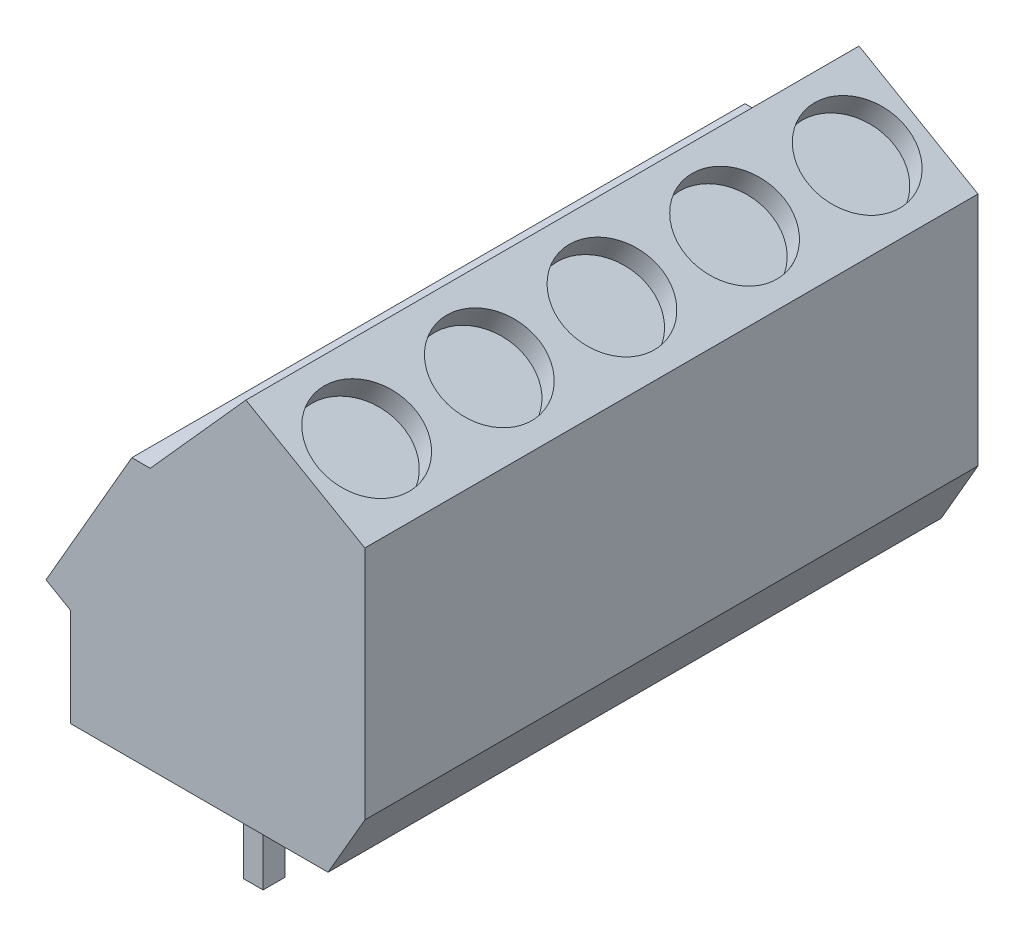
ISO-10303-21;
HEADER;
FILE_DESCRIPTION(('STEP AP214'),'2;1');
FILE_NAME('part.step','',(''),(''),'','','');
FILE_SCHEMA(('AUTOMOTIVE_DESIGN { 1 0 10303 214 1 1 1 1 }'));
ENDSEC;
DATA;
#1=APPLICATION_CONTEXT('core data for automotive mechanical design processes');
#2=APPLICATION_PROTOCOL_DEFINITION('international standard','automotive_design',2000,#1);
#3=PRODUCT_CONTEXT('',#1,'mechanical');
#4=PRODUCT('Part','Part','',(#3));
#5=PRODUCT_RELATED_PRODUCT_CATEGORY('part','',(#4));
#6=PRODUCT_DEFINITION_FORMATION('','',#4);
#7=PRODUCT_DEFINITION_CONTEXT('part definition',#1,'design');
#8=PRODUCT_DEFINITION('design','',#6,#7);
#9=PRODUCT_DEFINITION_SHAPE('','',#8);
#10=(LENGTH_UNIT() NAMED_UNIT(*) SI_UNIT(.MILLI.,.METRE.));
#11=(NAMED_UNIT(*) PLANE_ANGLE_UNIT() SI_UNIT($,.RADIAN.));
#12=(NAMED_UNIT(*) SI_UNIT($,.STERADIAN.) SOLID_ANGLE_UNIT());
#13=UNCERTAINTY_MEASURE_WITH_UNIT(LENGTH_MEASURE(1.E-05),#10,'distance_accuracy_value','');
#14=(GEOMETRIC_REPRESENTATION_CONTEXT(3) GLOBAL_UNCERTAINTY_ASSIGNED_CONTEXT((#13)) GLOBAL_UNIT_ASSIGNED_CONTEXT((#10,
#11,#12)) REPRESENTATION_CONTEXT('',''));
#15=CARTESIAN_POINT('',(0.,0.,0.));
#16=DIRECTION('',(0.,0.,1.));
#17=DIRECTION('',(1.,0.,0.));
#18=AXIS2_PLACEMENT_3D('',#15,#16,#17);
#19=CARTESIAN_POINT('',(-12.,0.,25.));
#20=DIRECTION('',(0.,1.,0.));
#21=DIRECTION('',(0.,0.,1.));
#22=AXIS2_PLACEMENT_3D('',#19,#20,#21);
#23=PLANE('',#22);
#24=DIRECTION('',(0.,0.,-1.));
#25=VECTOR('',#24,1.);
#26=CARTESIAN_POINT('',(-7.00000000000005,0.,17.95));
#27=LINE('',#26,#25);
#28=CARTESIAN_POINT('',(-7.00000000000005,0.,17.95));
#29=VERTEX_POINT('',#28);
#30=CARTESIAN_POINT('',(-7.00000000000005,0.,17.05));
#31=VERTEX_POINT('',#30);
#32=EDGE_CURVE('E457',#29,#31,#27,.T.);
#33=ORIENTED_EDGE('',*,*,#32,.F.);
#34=DIRECTION('',(-1.,0.,0.));
#35=VECTOR('',#34,1.);
#36=CARTESIAN_POINT('',(-7.00000000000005,0.,17.95));
#37=LINE('',#36,#35);
#38=CARTESIAN_POINT('',(-6.20000000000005,0.,17.95));
#39=VERTEX_POINT('',#38);
#40=EDGE_CURVE('E470',#39,#29,#37,.T.);
#41=ORIENTED_EDGE('',*,*,#40,.F.);
#42=DIRECTION('',(0.,0.,1.));
#43=VECTOR('',#42,1.);
#44=CARTESIAN_POINT('',(-6.20000000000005,0.,17.95));
#45=LINE('',#44,#43);
#46=CARTESIAN_POINT('',(-6.20000000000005,0.,17.05));
#47=VERTEX_POINT('',#46);
#48=EDGE_CURVE('E479',#47,#39,#45,.T.);
#49=ORIENTED_EDGE('',*,*,#48,.F.);
#50=DIRECTION('',(1.,0.,0.));
#51=VECTOR('',#50,1.);
#52=CARTESIAN_POINT('',(-7.00000000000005,0.,17.05));
#53=LINE('',#52,#51);
#54=EDGE_CURVE('E460',#31,#47,#53,.T.);
#55=ORIENTED_EDGE('',*,*,#54,.F.);
#56=EDGE_LOOP('',(#33,#41,#49,#55));
#57=FACE_BOUND('',#56,.T.);
#58=DIRECTION('',(0.,0.,-1.));
#59=VECTOR('',#58,1.);
#60=CARTESIAN_POINT('',(-7.00000000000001,0.,7.95));
#61=LINE('',#60,#59);
#62=CARTESIAN_POINT('',(-7.00000000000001,0.,7.95));
#63=VERTEX_POINT('',#62);
#64=CARTESIAN_POINT('',(-7.00000000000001,0.,7.05));
#65=VERTEX_POINT('',#64);
#66=EDGE_CURVE('E528',#63,#65,#61,.T.);
#67=ORIENTED_EDGE('',*,*,#66,.F.);
#68=DIRECTION('',(-1.,0.,0.));
#69=VECTOR('',#68,1.);
#70=CARTESIAN_POINT('',(-7.00000000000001,0.,7.95));
#71=LINE('',#70,#69);
#72=CARTESIAN_POINT('',(-6.20000000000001,0.,7.95));
#73=VERTEX_POINT('',#72);
#74=EDGE_CURVE('E533',#73,#63,#71,.T.);
#75=ORIENTED_EDGE('',*,*,#74,.F.);
#76=DIRECTION('',(0.,0.,1.));
#77=VECTOR('',#76,1.);
#78=CARTESIAN_POINT('',(-6.20000000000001,0.,7.95));
#79=LINE('',#78,#77);
#80=CARTESIAN_POINT('',(-6.20000000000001,0.,7.05));
#81=VERTEX_POINT('',#80);
#82=EDGE_CURVE('E545',#81,#73,#79,.T.);
#83=ORIENTED_EDGE('',*,*,#82,.F.);
#84=DIRECTION('',(1.,0.,0.));
#85=VECTOR('',#84,1.);
#86=CARTESIAN_POINT('',(-7.00000000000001,0.,7.05));
#87=LINE('',#86,#85);
#88=EDGE_CURVE('E542',#65,#81,#87,.T.);
#89=ORIENTED_EDGE('',*,*,#88,.F.);
#90=EDGE_LOOP('',(#67,#75,#83,#89));
#91=FACE_BOUND('',#90,.T.);
#92=DIRECTION('',(1.,0.,0.));
#93=VECTOR('',#92,1.);
#94=CARTESIAN_POINT('',(-12.,0.,0.));
#95=LINE('',#94,#93);
#96=CARTESIAN_POINT('',(-12.,0.,0.));
#97=VERTEX_POINT('',#96);
#98=CARTESIAN_POINT('',(-1.5,0.,0.));
#99=VERTEX_POINT('',#98);
#100=EDGE_CURVE('E772',#97,#99,#95,.T.);
#101=ORIENTED_EDGE('',*,*,#100,.T.);
#102=DIRECTION('',(0.,0.,-1.));
#103=VECTOR('',#102,1.);
#104=CARTESIAN_POINT('',(-1.5,0.,25.));
#105=LINE('',#104,#103);
#106=CARTESIAN_POINT('',(-1.5,0.,25.));
#107=VERTEX_POINT('',#106);
#108=EDGE_CURVE('E807',#107,#99,#105,.T.);
#109=ORIENTED_EDGE('',*,*,#108,.F.);
#110=DIRECTION('',(1.,0.,0.));
#111=VECTOR('',#110,1.);
#112=CARTESIAN_POINT('',(-12.,0.,25.));
#113=LINE('',#112,#111);
#114=CARTESIAN_POINT('',(-12.,0.,25.));
#115=VERTEX_POINT('',#114);
#116=EDGE_CURVE('E752',#115,#107,#113,.T.);
#117=ORIENTED_EDGE('',*,*,#116,.F.);
#118=DIRECTION('',(0.,0.,-1.));
#119=VECTOR('',#118,1.);
#120=CARTESIAN_POINT('',(-12.,0.,25.));
#121=LINE('',#120,#119);
#122=EDGE_CURVE('E810',#115,#97,#121,.T.);
#123=ORIENTED_EDGE('',*,*,#122,.T.);
#124=EDGE_LOOP('',(#101,#109,#117,#123));
#125=FACE_BOUND('',#124,.T.);
#126=DIRECTION('',(0.,0.,-1.));
#127=VECTOR('',#126,1.);
#128=CARTESIAN_POINT('',(-6.99999999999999,0.,2.95));
#129=LINE('',#128,#127);
#130=CARTESIAN_POINT('',(-6.99999999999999,0.,2.95));
#131=VERTEX_POINT('',#130);
#132=CARTESIAN_POINT('',(-6.99999999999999,0.,2.05));
#133=VERTEX_POINT('',#132);
#134=EDGE_CURVE('E561',#131,#133,#129,.T.);
#135=ORIENTED_EDGE('',*,*,#134,.F.);
#136=DIRECTION('',(-1.,0.,0.));
#137=VECTOR('',#136,1.);
#138=CARTESIAN_POINT('',(-6.99999999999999,0.,2.95));
#139=LINE('',#138,#137);
#140=CARTESIAN_POINT('',(-6.19999999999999,0.,2.95));
#141=VERTEX_POINT('',#140);
#142=EDGE_CURVE('E566',#141,#131,#139,.T.);
#143=ORIENTED_EDGE('',*,*,#142,.F.);
#144=DIRECTION('',(0.,0.,1.));
#145=VECTOR('',#144,1.);
#146=CARTESIAN_POINT('',(-6.19999999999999,0.,2.95));
#147=LINE('',#146,#145);
#148=CARTESIAN_POINT('',(-6.19999999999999,0.,2.05));
#149=VERTEX_POINT('',#148);
#150=EDGE_CURVE('E578',#149,#141,#147,.T.);
#151=ORIENTED_EDGE('',*,*,#150,.F.);
#152=DIRECTION('',(1.,0.,0.));
#153=VECTOR('',#152,1.);
#154=CARTESIAN_POINT('',(-6.99999999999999,0.,2.05));
#155=LINE('',#154,#153);
#156=EDGE_CURVE('E575',#133,#149,#155,.T.);
#157=ORIENTED_EDGE('',*,*,#156,.F.);
#158=EDGE_LOOP('',(#135,#143,#151,#157));
#159=FACE_BOUND('',#158,.T.);
#160=DIRECTION('',(0.,0.,-1.));
#161=VECTOR('',#160,1.);
#162=CARTESIAN_POINT('',(-7.00000000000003,0.,12.95));
#163=LINE('',#162,#161);
#164=CARTESIAN_POINT('',(-7.00000000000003,0.,12.95));
#165=VERTEX_POINT('',#164);
#166=CARTESIAN_POINT('',(-7.00000000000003,0.,12.05));
#167=VERTEX_POINT('',#166);
#168=EDGE_CURVE('E495',#165,#167,#163,.T.);
#169=ORIENTED_EDGE('',*,*,#168,.F.);
#170=DIRECTION('',(-1.,0.,0.));
#171=VECTOR('',#170,1.);
#172=CARTESIAN_POINT('',(-7.00000000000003,0.,12.95));
#173=LINE('',#172,#171);
#174=CARTESIAN_POINT('',(-6.20000000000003,0.,12.95));
#175=VERTEX_POINT('',#174);
#176=EDGE_CURVE('E500',#175,#165,#173,.T.);
#177=ORIENTED_EDGE('',*,*,#176,.F.);
#178=DIRECTION('',(0.,0.,1.));
#179=VECTOR('',#178,1.);
#180=CARTESIAN_POINT('',(-6.20000000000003,0.,12.95));
#181=LINE('',#180,#179);
#182=CARTESIAN_POINT('',(-6.20000000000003,0.,12.05));
#183=VERTEX_POINT('',#182);
#184=EDGE_CURVE('E512',#183,#175,#181,.T.);
#185=ORIENTED_EDGE('',*,*,#184,.F.);
#186=DIRECTION('',(1.,0.,0.));
#187=VECTOR('',#186,1.);
#188=CARTESIAN_POINT('',(-7.00000000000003,0.,12.05));
#189=LINE('',#188,#187);
#190=EDGE_CURVE('E509',#167,#183,#189,.T.);
#191=ORIENTED_EDGE('',*,*,#190,.F.);
#192=EDGE_LOOP('',(#169,#177,#185,#191));
#193=FACE_BOUND('',#192,.T.);
#194=DIRECTION('',(0.,0.,-1.));
#195=VECTOR('',#194,1.);
#196=CARTESIAN_POINT('',(-7.00000000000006,0.,22.95));
#197=LINE('',#196,#195);
#198=CARTESIAN_POINT('',(-7.00000000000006,0.,22.95));
#199=VERTEX_POINT('',#198);
#200=CARTESIAN_POINT('',(-7.00000000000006,0.,22.05));
#201=VERTEX_POINT('',#200);
#202=EDGE_CURVE('E456',#199,#201,#197,.T.);
#203=ORIENTED_EDGE('',*,*,#202,.F.);
#204=DIRECTION('',(-1.,0.,0.));
#205=VECTOR('',#204,1.);
#206=CARTESIAN_POINT('',(-7.00000000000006,0.,22.95));
#207=LINE('',#206,#205);
#208=CARTESIAN_POINT('',(-6.20000000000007,0.,22.95));
#209=VERTEX_POINT('',#208);
#210=EDGE_CURVE('E453',#209,#199,#207,.T.);
#211=ORIENTED_EDGE('',*,*,#210,.F.);
#212=DIRECTION('',(0.,0.,1.));
#213=VECTOR('',#212,1.);
#214=CARTESIAN_POINT('',(-6.20000000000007,0.,22.95));
#215=LINE('',#214,#213);
#216=CARTESIAN_POINT('',(-6.20000000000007,0.,22.05));
#217=VERTEX_POINT('',#216);
#218=EDGE_CURVE('E55',#217,#209,#215,.T.);
#219=ORIENTED_EDGE('',*,*,#218,.F.);
#220=DIRECTION('',(1.,0.,0.));
#221=VECTOR('',#220,1.);
#222=CARTESIAN_POINT('',(-7.00000000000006,0.,22.05));
#223=LINE('',#222,#221);
#224=EDGE_CURVE('E50',#201,#217,#223,.T.);
#225=ORIENTED_EDGE('',*,*,#224,.F.);
#226=EDGE_LOOP('',(#203,#211,#219,#225));
#227=FACE_BOUND('',#226,.T.);
#228=ADVANCED_FACE('F33',(#57,#91,#125,#159,#193,#227),#23,.F.);
#229=CARTESIAN_POINT('',(-12.,4.,25.));
#230=DIRECTION('',(1.,0.,0.));
#231=DIRECTION('',(0.,0.,-1.));
#232=AXIS2_PLACEMENT_3D('',#229,#230,#231);
#233=PLANE('',#232);
#234=DIRECTION('',(0.,-1.,0.));
#235=VECTOR('',#234,1.);
#236=CARTESIAN_POINT('',(-12.,4.,0.));
#237=LINE('',#236,#235);
#238=CARTESIAN_POINT('',(-12.,4.,0.));
#239=VERTEX_POINT('',#238);
#240=EDGE_CURVE('E740',#239,#97,#237,.T.);
#241=ORIENTED_EDGE('',*,*,#240,.T.);
#242=ORIENTED_EDGE('',*,*,#122,.F.);
#243=DIRECTION('',(0.,-1.,0.));
#244=VECTOR('',#243,1.);
#245=CARTESIAN_POINT('',(-12.,4.,25.));
#246=LINE('',#245,#244);
#247=CARTESIAN_POINT('',(-12.,4.,25.));
#248=VERTEX_POINT('',#247);
#249=EDGE_CURVE('E749',#248,#115,#246,.T.);
#250=ORIENTED_EDGE('',*,*,#249,.F.);
#251=DIRECTION('',(0.,0.,-1.));
#252=VECTOR('',#251,1.);
#253=CARTESIAN_POINT('',(-12.,4.,25.));
#254=LINE('',#253,#252);
#255=EDGE_CURVE('E769',#248,#239,#254,.T.);
#256=ORIENTED_EDGE('',*,*,#255,.T.);
#257=EDGE_LOOP('',(#241,#242,#250,#256));
#258=FACE_BOUND('',#257,.T.);
#259=ADVANCED_FACE('F1013',(#258),#233,.F.);
#260=CARTESIAN_POINT('',(-1.5,0.,25.));
#261=DIRECTION('',(-0.866025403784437,0.500000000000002,0.));
#262=DIRECTION('',(-0.500000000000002,-0.866025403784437,0.));
#263=AXIS2_PLACEMENT_3D('',#260,#261,#262);
#264=PLANE('',#263);
#265=DIRECTION('',(0.500000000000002,0.866025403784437,0.));
#266=VECTOR('',#265,1.);
#267=CARTESIAN_POINT('',(-1.5,0.,0.));
#268=LINE('',#267,#266);
#269=CARTESIAN_POINT('',(0.,2.5980762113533,0.));
#270=VERTEX_POINT('',#269);
#271=EDGE_CURVE('E774',#99,#270,#268,.T.);
#272=ORIENTED_EDGE('',*,*,#271,.T.);
#273=DIRECTION('',(0.,0.,-1.));
#274=VECTOR('',#273,1.);
#275=CARTESIAN_POINT('',(0.,2.5980762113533,25.));
#276=LINE('',#275,#274);
#277=CARTESIAN_POINT('',(0.,2.5980762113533,25.));
#278=VERTEX_POINT('',#277);
#279=EDGE_CURVE('E804',#278,#270,#276,.T.);
#280=ORIENTED_EDGE('',*,*,#279,.F.);
#281=DIRECTION('',(0.500000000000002,0.866025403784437,0.));
#282=VECTOR('',#281,1.);
#283=CARTESIAN_POINT('',(-1.5,0.,25.));
#284=LINE('',#283,#282);
#285=EDGE_CURVE('E755',#107,#278,#284,.T.);
#286=ORIENTED_EDGE('',*,*,#285,.F.);
#287=ORIENTED_EDGE('',*,*,#108,.T.);
#288=EDGE_LOOP('',(#272,#280,#286,#287));
#289=FACE_BOUND('',#288,.T.);
#290=ADVANCED_FACE('F1019',(#289),#264,.F.);
#291=CARTESIAN_POINT('',(0.,2.5980762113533,25.));
#292=DIRECTION('',(-1.,0.,0.));
#293=DIRECTION('',(0.,0.,1.));
#294=AXIS2_PLACEMENT_3D('',#291,#292,#293);
#295=PLANE('',#294);
#296=DIRECTION('',(0.,1.,0.));
#297=VECTOR('',#296,1.);
#298=CARTESIAN_POINT('',(0.,2.5980762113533,0.));
#299=LINE('',#298,#297);
#300=CARTESIAN_POINT('',(0.,12.2,0.));
#301=VERTEX_POINT('',#300);
#302=EDGE_CURVE('E776',#270,#301,#299,.T.);
#303=ORIENTED_EDGE('',*,*,#302,.T.);
#304=DIRECTION('',(0.,0.,-1.));
#305=VECTOR('',#304,1.);
#306=CARTESIAN_POINT('',(0.,12.2,25.));
#307=LINE('',#306,#305);
#308=CARTESIAN_POINT('',(0.,12.2,25.));
#309=VERTEX_POINT('',#308);
#310=EDGE_CURVE('E801',#309,#301,#307,.T.);
#311=ORIENTED_EDGE('',*,*,#310,.F.);
#312=DIRECTION('',(0.,1.,0.));
#313=VECTOR('',#312,1.);
#314=CARTESIAN_POINT('',(0.,2.5980762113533,25.));
#315=LINE('',#314,#313);
#316=EDGE_CURVE('E757',#278,#309,#315,.T.);
#317=ORIENTED_EDGE('',*,*,#316,.F.);
#318=ORIENTED_EDGE('',*,*,#279,.T.);
#319=EDGE_LOOP('',(#303,#311,#317,#318));
#320=FACE_BOUND('',#319,.T.);
#321=ADVANCED_FACE('F1453',(#320),#295,.F.);
#322=CARTESIAN_POINT('',(0.,12.2,25.));
#323=DIRECTION('',(-0.500000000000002,-0.866025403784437,0.));
#324=DIRECTION('',(0.866025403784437,-0.500000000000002,0.));
#325=AXIS2_PLACEMENT_3D('',#322,#323,#324);
#326=PLANE('',#325);
#327=CARTESIAN_POINT('',(-2.42487113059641,13.6,7.5));
#328=DIRECTION('',(0.500000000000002,0.866025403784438,0.));
#329=DIRECTION('',(-0.866025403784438,0.500000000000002,0.));
#330=AXIS2_PLACEMENT_3D('',#327,#328,#329);
#331=CIRCLE('',#330,2.);
#332=CARTESIAN_POINT('',(-4.15692193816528,14.6,7.5));
#333=VERTEX_POINT('',#332);
#334=EDGE_CURVE('E599',#333,#333,#331,.T.);
#335=ORIENTED_EDGE('',*,*,#334,.F.);
#336=EDGE_LOOP('',(#335));
#337=FACE_BOUND('',#336,.T.);
#338=CARTESIAN_POINT('',(-2.4248711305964,13.6,12.5));
#339=DIRECTION('',(0.500000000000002,0.866025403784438,0.));
#340=DIRECTION('',(-0.866025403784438,0.500000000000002,0.));
#341=AXIS2_PLACEMENT_3D('',#338,#339,#340);
#342=CIRCLE('',#341,2.);
#343=CARTESIAN_POINT('',(-4.15692193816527,14.6,12.5));
#344=VERTEX_POINT('',#343);
#345=EDGE_CURVE('E605',#344,#344,#342,.T.);
#346=ORIENTED_EDGE('',*,*,#345,.F.);
#347=EDGE_LOOP('',(#346));
#348=FACE_BOUND('',#347,.T.);
#349=CARTESIAN_POINT('',(-2.42487113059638,13.6,17.5));
#350=DIRECTION('',(0.500000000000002,0.866025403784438,0.));
#351=DIRECTION('',(-0.866025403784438,0.500000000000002,0.));
#352=AXIS2_PLACEMENT_3D('',#349,#350,#351);
#353=CIRCLE('',#352,2.);
#354=CARTESIAN_POINT('',(-4.15692193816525,14.6,17.5));
#355=VERTEX_POINT('',#354);
#356=EDGE_CURVE('E611',#355,#355,#353,.T.);
#357=ORIENTED_EDGE('',*,*,#356,.F.);
#358=EDGE_LOOP('',(#357));
#359=FACE_BOUND('',#358,.T.);
#360=CARTESIAN_POINT('',(-2.42487113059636,13.6,22.5));
#361=DIRECTION('',(0.500000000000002,0.866025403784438,0.));
#362=DIRECTION('',(-0.866025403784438,0.500000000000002,0.));
#363=AXIS2_PLACEMENT_3D('',#360,#361,#362);
#364=CIRCLE('',#363,2.);
#365=CARTESIAN_POINT('',(-4.15692193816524,14.6,22.5));
#366=VERTEX_POINT('',#365);
#367=EDGE_CURVE('E594',#366,#366,#364,.T.);
#368=ORIENTED_EDGE('',*,*,#367,.F.);
#369=EDGE_LOOP('',(#368));
#370=FACE_BOUND('',#369,.T.);
#371=CARTESIAN_POINT('',(-2.42487113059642,13.6,2.5));
#372=DIRECTION('',(0.500000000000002,0.866025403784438,0.));
#373=DIRECTION('',(-0.866025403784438,0.500000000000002,0.));
#374=AXIS2_PLACEMENT_3D('',#371,#372,#373);
#375=CIRCLE('',#374,2.);
#376=CARTESIAN_POINT('',(-4.1569219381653,14.6,2.5));
#377=VERTEX_POINT('',#376);
#378=EDGE_CURVE('E598',#377,#377,#375,.T.);
#379=ORIENTED_EDGE('',*,*,#378,.F.);
#380=EDGE_LOOP('',(#379));
#381=FACE_BOUND('',#380,.T.);
#382=DIRECTION('',(-0.866025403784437,0.500000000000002,0.));
#383=VECTOR('',#382,1.);
#384=CARTESIAN_POINT('',(0.,12.2,0.));
#385=LINE('',#384,#383);
#386=CARTESIAN_POINT('',(-4.84974226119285,15.,0.));
#387=VERTEX_POINT('',#386);
#388=EDGE_CURVE('E778',#301,#387,#385,.T.);
#389=ORIENTED_EDGE('',*,*,#388,.T.);
#390=DIRECTION('',(0.,0.,-1.));
#391=VECTOR('',#390,1.);
#392=CARTESIAN_POINT('',(-4.84974226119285,15.,25.));
#393=LINE('',#392,#391);
#394=CARTESIAN_POINT('',(-4.84974226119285,15.,25.));
#395=VERTEX_POINT('',#394);
#396=EDGE_CURVE('E798',#395,#387,#393,.T.);
#397=ORIENTED_EDGE('',*,*,#396,.F.);
#398=DIRECTION('',(-0.866025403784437,0.500000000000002,0.));
#399=VECTOR('',#398,1.);
#400=CARTESIAN_POINT('',(0.,12.2,25.));
#401=LINE('',#400,#399);
#402=EDGE_CURVE('E759',#309,#395,#401,.T.);
#403=ORIENTED_EDGE('',*,*,#402,.F.);
#404=ORIENTED_EDGE('',*,*,#310,.T.);
#405=EDGE_LOOP('',(#389,#397,#403,#404));
#406=FACE_BOUND('',#405,.T.);
#407=ADVANCED_FACE('F1445',(#337,#348,#359,#370,#381,#406),#326,.F.);
#408=CARTESIAN_POINT('',(-4.84974226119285,15.,25.));
#409=DIRECTION('',(0.745344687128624,-0.666679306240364,0.));
#410=DIRECTION('',(0.666679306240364,0.745344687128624,0.));
#411=AXIS2_PLACEMENT_3D('',#408,#409,#410);
#412=PLANE('',#411);
#413=DIRECTION('',(-0.666679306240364,-0.745344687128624,0.));
#414=VECTOR('',#413,1.);
#415=CARTESIAN_POINT('',(-4.84974226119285,15.,0.));
#416=LINE('',#415,#414);
#417=CARTESIAN_POINT('',(-8.74999999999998,10.6395280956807,0.));
#418=VERTEX_POINT('',#417);
#419=EDGE_CURVE('E780',#387,#418,#416,.T.);
#420=ORIENTED_EDGE('',*,*,#419,.T.);
#421=DIRECTION('',(0.,0.,-1.));
#422=VECTOR('',#421,1.);
#423=CARTESIAN_POINT('',(-8.74999999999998,10.6395280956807,25.));
#424=LINE('',#423,#422);
#425=CARTESIAN_POINT('',(-8.74999999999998,10.6395280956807,25.));
#426=VERTEX_POINT('',#425);
#427=EDGE_CURVE('E795',#426,#418,#424,.T.);
#428=ORIENTED_EDGE('',*,*,#427,.F.);
#429=DIRECTION('',(-0.666679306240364,-0.745344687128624,0.));
#430=VECTOR('',#429,1.);
#431=CARTESIAN_POINT('',(-4.84974226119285,15.,25.));
#432=LINE('',#431,#430);
#433=EDGE_CURVE('E761',#395,#426,#432,.T.);
#434=ORIENTED_EDGE('',*,*,#433,.F.);
#435=ORIENTED_EDGE('',*,*,#396,.T.);
#436=EDGE_LOOP('',(#420,#428,#434,#435));
#437=FACE_BOUND('',#436,.T.);
#438=ADVANCED_FACE('F1435',(#437),#412,.F.);
#439=CARTESIAN_POINT('',(-8.74999999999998,10.6395280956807,25.));
#440=DIRECTION('',(0.,-1.,0.));
#441=DIRECTION('',(1.,0.,0.));
#442=AXIS2_PLACEMENT_3D('',#439,#440,#441);
#443=PLANE('',#442);
#444=DIRECTION('',(-1.,0.,0.));
#445=VECTOR('',#444,1.);
#446=CARTESIAN_POINT('',(-8.74999999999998,10.6395280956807,0.));
#447=LINE('',#446,#445);
#448=CARTESIAN_POINT('',(-9.49999999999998,10.6395280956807,0.));
#449=VERTEX_POINT('',#448);
#450=EDGE_CURVE('E782',#418,#449,#447,.T.);
#451=ORIENTED_EDGE('',*,*,#450,.T.);
#452=DIRECTION('',(0.,0.,-1.));
#453=VECTOR('',#452,1.);
#454=CARTESIAN_POINT('',(-9.49999999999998,10.6395280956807,25.));
#455=LINE('',#454,#453);
#456=CARTESIAN_POINT('',(-9.49999999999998,10.6395280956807,25.));
#457=VERTEX_POINT('',#456);
#458=EDGE_CURVE('E792',#457,#449,#455,.T.);
#459=ORIENTED_EDGE('',*,*,#458,.F.);
#460=DIRECTION('',(-1.,0.,0.));
#461=VECTOR('',#460,1.);
#462=CARTESIAN_POINT('',(-8.74999999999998,10.6395280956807,25.));
#463=LINE('',#462,#461);
#464=EDGE_CURVE('E763',#426,#457,#463,.T.);
#465=ORIENTED_EDGE('',*,*,#464,.F.);
#466=ORIENTED_EDGE('',*,*,#427,.T.);
#467=EDGE_LOOP('',(#451,#459,#465,#466));
#468=FACE_BOUND('',#467,.T.);
#469=ADVANCED_FACE('F1324',(#468),#443,.F.);
#470=CARTESIAN_POINT('',(-9.49999999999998,10.6395280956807,25.));
#471=DIRECTION('',(0.866025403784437,-0.500000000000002,0.));
#472=DIRECTION('',(0.500000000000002,0.866025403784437,0.));
#473=AXIS2_PLACEMENT_3D('',#470,#471,#472);
#474=PLANE('',#473);
#475=DIRECTION('',(0.500000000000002,0.866025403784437,0.));
#476=VECTOR('',#475,1.);
#477=CARTESIAN_POINT('',(-9.49999999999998,10.6395280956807,10.7));
#478=LINE('',#477,#476);
#479=CARTESIAN_POINT('',(-12.25,5.87638837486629,10.7));
#480=VERTEX_POINT('',#479);
#481=CARTESIAN_POINT('',(-9.74999999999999,10.2065153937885,10.7));
#482=VERTEX_POINT('',#481);
#483=EDGE_CURVE('E916',#480,#482,#478,.T.);
#484=ORIENTED_EDGE('',*,*,#483,.T.);
#485=DIRECTION('',(0.,0.,1.));
#486=VECTOR('',#485,1.);
#487=CARTESIAN_POINT('',(-9.74999999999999,10.2065153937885,25.));
#488=LINE('',#487,#486);
#489=CARTESIAN_POINT('',(-9.74999999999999,10.2065153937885,14.3));
#490=VERTEX_POINT('',#489);
#491=EDGE_CURVE('E858',#482,#490,#488,.T.);
#492=ORIENTED_EDGE('',*,*,#491,.T.);
#493=DIRECTION('',(-0.500000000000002,-0.866025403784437,0.));
#494=VECTOR('',#493,1.);
#495=CARTESIAN_POINT('',(-9.49999999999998,10.6395280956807,14.3));
#496=LINE('',#495,#494);
#497=CARTESIAN_POINT('',(-12.25,5.87638837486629,14.3));
#498=VERTEX_POINT('',#497);
#499=EDGE_CURVE('E912',#490,#498,#496,.T.);
#500=ORIENTED_EDGE('',*,*,#499,.T.);
#501=DIRECTION('',(0.,0.,-1.));
#502=VECTOR('',#501,1.);
#503=CARTESIAN_POINT('',(-12.25,5.87638837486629,25.));
#504=LINE('',#503,#502);
#505=EDGE_CURVE('E914',#498,#480,#504,.T.);
#506=ORIENTED_EDGE('',*,*,#505,.T.);
#507=EDGE_LOOP('',(#484,#492,#500,#506));
#508=FACE_BOUND('',#507,.T.);
#509=DIRECTION('',(0.500000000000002,0.866025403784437,0.));
#510=VECTOR('',#509,1.);
#511=CARTESIAN_POINT('',(-9.49999999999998,10.6395280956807,15.7));
#512=LINE('',#511,#510);
#513=CARTESIAN_POINT('',(-12.25,5.87638837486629,15.7));
#514=VERTEX_POINT('',#513);
#515=CARTESIAN_POINT('',(-9.74999999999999,10.2065153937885,15.7));
#516=VERTEX_POINT('',#515);
#517=EDGE_CURVE('E940',#514,#516,#512,.T.);
#518=ORIENTED_EDGE('',*,*,#517,.T.);
#519=DIRECTION('',(0.,0.,1.));
#520=VECTOR('',#519,1.);
#521=CARTESIAN_POINT('',(-9.74999999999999,10.2065153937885,25.));
#522=LINE('',#521,#520);
#523=CARTESIAN_POINT('',(-9.74999999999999,10.2065153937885,19.3));
#524=VERTEX_POINT('',#523);
#525=EDGE_CURVE('E868',#516,#524,#522,.T.);
#526=ORIENTED_EDGE('',*,*,#525,.T.);
#527=DIRECTION('',(-0.500000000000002,-0.866025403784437,0.));
#528=VECTOR('',#527,1.);
#529=CARTESIAN_POINT('',(-9.49999999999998,10.6395280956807,19.3));
#530=LINE('',#529,#528);
#531=CARTESIAN_POINT('',(-12.25,5.87638837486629,19.3));
#532=VERTEX_POINT('',#531);
#533=EDGE_CURVE('E936',#524,#532,#530,.T.);
#534=ORIENTED_EDGE('',*,*,#533,.T.);
#535=DIRECTION('',(0.,0.,-1.));
#536=VECTOR('',#535,1.);
#537=CARTESIAN_POINT('',(-12.25,5.87638837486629,25.));
#538=LINE('',#537,#536);
#539=EDGE_CURVE('E938',#532,#514,#538,.T.);
#540=ORIENTED_EDGE('',*,*,#539,.T.);
#541=EDGE_LOOP('',(#518,#526,#534,#540));
#542=FACE_BOUND('',#541,.T.);
#543=DIRECTION('',(0.500000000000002,0.866025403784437,0.));
#544=VECTOR('',#543,1.);
#545=CARTESIAN_POINT('',(-9.49999999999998,10.6395280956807,20.7));
#546=LINE('',#545,#544);
#547=CARTESIAN_POINT('',(-12.25,5.87638837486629,20.7));
#548=VERTEX_POINT('',#547);
#549=CARTESIAN_POINT('',(-9.74999999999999,10.2065153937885,20.7));
#550=VERTEX_POINT('',#549);
#551=EDGE_CURVE('E963',#548,#550,#546,.T.);
#552=ORIENTED_EDGE('',*,*,#551,.T.);
#553=DIRECTION('',(0.,0.,1.));
#554=VECTOR('',#553,1.);
#555=CARTESIAN_POINT('',(-9.74999999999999,10.2065153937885,25.));
#556=LINE('',#555,#554);
#557=CARTESIAN_POINT('',(-9.74999999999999,10.2065153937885,24.3));
#558=VERTEX_POINT('',#557);
#559=EDGE_CURVE('E878',#550,#558,#556,.T.);
#560=ORIENTED_EDGE('',*,*,#559,.T.);
#561=DIRECTION('',(-0.500000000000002,-0.866025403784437,0.));
#562=VECTOR('',#561,1.);
#563=CARTESIAN_POINT('',(-9.49999999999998,10.6395280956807,24.3));
#564=LINE('',#563,#562);
#565=CARTESIAN_POINT('',(-12.25,5.87638837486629,24.3));
#566=VERTEX_POINT('',#565);
#567=EDGE_CURVE('E959',#558,#566,#564,.T.);
#568=ORIENTED_EDGE('',*,*,#567,.T.);
#569=DIRECTION('',(0.,0.,-1.));
#570=VECTOR('',#569,1.);
#571=CARTESIAN_POINT('',(-12.25,5.87638837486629,25.));
#572=LINE('',#571,#570);
#573=EDGE_CURVE('E961',#566,#548,#572,.T.);
#574=ORIENTED_EDGE('',*,*,#573,.T.);
#575=EDGE_LOOP('',(#552,#560,#568,#574));
#576=FACE_BOUND('',#575,.T.);
#577=DIRECTION('',(0.500000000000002,0.866025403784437,0.));
#578=VECTOR('',#577,1.);
#579=CARTESIAN_POINT('',(-9.49999999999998,10.6395280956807,5.70000000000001));
#580=LINE('',#579,#578);
#581=CARTESIAN_POINT('',(-12.25,5.87638837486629,5.70000000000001));
#582=VERTEX_POINT('',#581);
#583=CARTESIAN_POINT('',(-9.74999999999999,10.2065153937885,5.70000000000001));
#584=VERTEX_POINT('',#583);
#585=EDGE_CURVE('E892',#582,#584,#580,.T.);
#586=ORIENTED_EDGE('',*,*,#585,.T.);
#587=DIRECTION('',(0.,0.,1.));
#588=VECTOR('',#587,1.);
#589=CARTESIAN_POINT('',(-9.74999999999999,10.2065153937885,25.));
#590=LINE('',#589,#588);
#591=CARTESIAN_POINT('',(-9.74999999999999,10.2065153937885,9.3));
#592=VERTEX_POINT('',#591);
#593=EDGE_CURVE('E848',#584,#592,#590,.T.);
#594=ORIENTED_EDGE('',*,*,#593,.T.);
#595=DIRECTION('',(-0.500000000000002,-0.866025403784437,0.));
#596=VECTOR('',#595,1.);
#597=CARTESIAN_POINT('',(-9.49999999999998,10.6395280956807,9.3));
#598=LINE('',#597,#596);
#599=CARTESIAN_POINT('',(-12.25,5.87638837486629,9.3));
#600=VERTEX_POINT('',#599);
#601=EDGE_CURVE('E888',#592,#600,#598,.T.);
#602=ORIENTED_EDGE('',*,*,#601,.T.);
#603=DIRECTION('',(0.,0.,-1.));
#604=VECTOR('',#603,1.);
#605=CARTESIAN_POINT('',(-12.25,5.87638837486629,25.));
#606=LINE('',#605,#604);
#607=EDGE_CURVE('E890',#600,#582,#606,.T.);
#608=ORIENTED_EDGE('',*,*,#607,.T.);
#609=EDGE_LOOP('',(#586,#594,#602,#608));
#610=FACE_BOUND('',#609,.T.);
#611=DIRECTION('',(0.500000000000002,0.866025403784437,0.));
#612=VECTOR('',#611,1.);
#613=CARTESIAN_POINT('',(-9.49999999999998,10.6395280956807,0.700000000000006));
#614=LINE('',#613,#612);
#615=CARTESIAN_POINT('',(-12.25,5.87638837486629,0.700000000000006));
#616=VERTEX_POINT('',#615);
#617=CARTESIAN_POINT('',(-9.74999999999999,10.2065153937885,0.700000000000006));
#618=VERTEX_POINT('',#617);
#619=EDGE_CURVE('E830',#616,#618,#614,.T.);
#620=ORIENTED_EDGE('',*,*,#619,.T.);
#621=DIRECTION('',(0.,0.,1.));
#622=VECTOR('',#621,1.);
#623=CARTESIAN_POINT('',(-9.74999999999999,10.2065153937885,25.));
#624=LINE('',#623,#622);
#625=CARTESIAN_POINT('',(-9.74999999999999,10.2065153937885,4.29999999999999));
#626=VERTEX_POINT('',#625);
#627=EDGE_CURVE('E816',#618,#626,#624,.T.);
#628=ORIENTED_EDGE('',*,*,#627,.T.);
#629=DIRECTION('',(-0.500000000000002,-0.866025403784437,0.));
#630=VECTOR('',#629,1.);
#631=CARTESIAN_POINT('',(-9.49999999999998,10.6395280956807,4.29999999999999));
#632=LINE('',#631,#630);
#633=CARTESIAN_POINT('',(-12.25,5.87638837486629,4.29999999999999));
#634=VERTEX_POINT('',#633);
#635=EDGE_CURVE('E826',#626,#634,#632,.T.);
#636=ORIENTED_EDGE('',*,*,#635,.T.);
#637=DIRECTION('',(0.,0.,-1.));
#638=VECTOR('',#637,1.);
#639=CARTESIAN_POINT('',(-12.25,5.87638837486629,25.));
#640=LINE('',#639,#638);
#641=EDGE_CURVE('E828',#634,#616,#640,.T.);
#642=ORIENTED_EDGE('',*,*,#641,.T.);
#643=EDGE_LOOP('',(#620,#628,#636,#642));
#644=FACE_BOUND('',#643,.T.);
#645=DIRECTION('',(-0.500000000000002,-0.866025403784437,0.));
#646=VECTOR('',#645,1.);
#647=CARTESIAN_POINT('',(-9.49999999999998,10.6395280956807,0.));
#648=LINE('',#647,#646);
#649=CARTESIAN_POINT('',(-13.,4.57735026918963,0.));
#650=VERTEX_POINT('',#649);
#651=EDGE_CURVE('E784',#449,#650,#648,.T.);
#652=ORIENTED_EDGE('',*,*,#651,.T.);
#653=DIRECTION('',(0.,0.,-1.));
#654=VECTOR('',#653,1.);
#655=CARTESIAN_POINT('',(-13.,4.57735026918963,25.));
#656=LINE('',#655,#654);
#657=CARTESIAN_POINT('',(-13.,4.57735026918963,25.));
#658=VERTEX_POINT('',#657);
#659=EDGE_CURVE('E789',#658,#650,#656,.T.);
#660=ORIENTED_EDGE('',*,*,#659,.F.);
#661=DIRECTION('',(-0.500000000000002,-0.866025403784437,0.));
#662=VECTOR('',#661,1.);
#663=CARTESIAN_POINT('',(-9.49999999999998,10.6395280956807,25.));
#664=LINE('',#663,#662);
#665=EDGE_CURVE('E765',#457,#658,#664,.T.);
#666=ORIENTED_EDGE('',*,*,#665,.F.);
#667=ORIENTED_EDGE('',*,*,#458,.T.);
#668=EDGE_LOOP('',(#652,#660,#666,#667));
#669=FACE_BOUND('',#668,.T.);
#670=ADVANCED_FACE('F1318',(#508,#542,#576,#610,#644,#669),#474,.F.);
#671=CARTESIAN_POINT('',(-13.,4.57735026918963,25.));
#672=DIRECTION('',(0.500000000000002,0.866025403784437,0.));
#673=DIRECTION('',(-0.866025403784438,0.500000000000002,0.));
#674=AXIS2_PLACEMENT_3D('',#671,#672,#673);
#675=PLANE('',#674);
#676=DIRECTION('',(0.866025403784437,-0.500000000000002,0.));
#677=VECTOR('',#676,1.);
#678=CARTESIAN_POINT('',(-13.,4.57735026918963,0.));
#679=LINE('',#678,#677);
#680=EDGE_CURVE('E753',#650,#239,#679,.T.);
#681=ORIENTED_EDGE('',*,*,#680,.T.);
#682=ORIENTED_EDGE('',*,*,#255,.F.);
#683=DIRECTION('',(0.866025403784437,-0.500000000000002,0.));
#684=VECTOR('',#683,1.);
#685=CARTESIAN_POINT('',(-13.,4.57735026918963,25.));
#686=LINE('',#685,#684);
#687=EDGE_CURVE('E767',#658,#248,#686,.T.);
#688=ORIENTED_EDGE('',*,*,#687,.F.);
#689=ORIENTED_EDGE('',*,*,#659,.T.);
#690=EDGE_LOOP('',(#681,#682,#688,#689));
#691=FACE_BOUND('',#690,.T.);
#692=ADVANCED_FACE('F1323',(#691),#675,.F.);
#693=CARTESIAN_POINT('',(-12.,0.,25.));
#694=DIRECTION('',(0.,0.,1.));
#695=DIRECTION('',(1.,0.,0.));
#696=AXIS2_PLACEMENT_3D('',#693,#694,#695);
#697=PLANE('',#696);
#698=ORIENTED_EDGE('',*,*,#249,.T.);
#699=ORIENTED_EDGE('',*,*,#116,.T.);
#700=ORIENTED_EDGE('',*,*,#285,.T.);
#701=ORIENTED_EDGE('',*,*,#316,.T.);
#702=ORIENTED_EDGE('',*,*,#402,.T.);
#703=ORIENTED_EDGE('',*,*,#433,.T.);
#704=ORIENTED_EDGE('',*,*,#464,.T.);
#705=ORIENTED_EDGE('',*,*,#665,.T.);
#706=ORIENTED_EDGE('',*,*,#687,.T.);
#707=EDGE_LOOP('',(#698,#699,#700,#701,#702,#703,#704,#705,#706));
#708=FACE_BOUND('',#707,.T.);
#709=ADVANCED_FACE('F1411',(#708),#697,.T.);
#710=CARTESIAN_POINT('',(-12.,0.,0.));
#711=DIRECTION('',(0.,0.,1.));
#712=DIRECTION('',(1.,0.,0.));
#713=AXIS2_PLACEMENT_3D('',#710,#711,#712);
#714=PLANE('',#713);
#715=ORIENTED_EDGE('',*,*,#240,.F.);
#716=ORIENTED_EDGE('',*,*,#680,.F.);
#717=ORIENTED_EDGE('',*,*,#651,.F.);
#718=ORIENTED_EDGE('',*,*,#450,.F.);
#719=ORIENTED_EDGE('',*,*,#419,.F.);
#720=ORIENTED_EDGE('',*,*,#388,.F.);
#721=ORIENTED_EDGE('',*,*,#302,.F.);
#722=ORIENTED_EDGE('',*,*,#271,.F.);
#723=ORIENTED_EDGE('',*,*,#100,.F.);
#724=EDGE_LOOP('',(#715,#716,#717,#718,#719,#720,#721,#722,#723));
#725=FACE_BOUND('',#724,.T.);
#726=ADVANCED_FACE('F1387',(#725),#714,.F.);
#727=CARTESIAN_POINT('',(-6.16987298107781,6.40747728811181,1.2));
#728=DIRECTION('',(0.,0.,-1.));
#729=DIRECTION('',(-1.,0.,0.));
#730=AXIS2_PLACEMENT_3D('',#727,#728,#729);
#731=PLANE('',#730);
#732=DIRECTION('',(0.258819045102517,-0.965925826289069,0.));
#733=VECTOR('',#732,1.);
#734=CARTESIAN_POINT('',(-8.56041743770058,5.76693283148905,1.2));
#735=LINE('',#734,#733);
#736=CARTESIAN_POINT('',(-9.20096189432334,8.15747728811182,1.2));
#737=VERTEX_POINT('',#736);
#738=CARTESIAN_POINT('',(-9.56698729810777,9.52350269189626,1.2));
#739=VERTEX_POINT('',#738);
#740=EDGE_CURVE('E818',#737,#739,#735,.F.);
#741=ORIENTED_EDGE('',*,*,#740,.T.);
#742=DIRECTION('',(-0.500000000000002,-0.866025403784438,0.));
#743=VECTOR('',#742,1.);
#744=CARTESIAN_POINT('',(-10.0669872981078,8.65747728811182,1.2));
#745=LINE('',#744,#743);
#746=CARTESIAN_POINT('',(-11.5669872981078,6.05940107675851,1.2));
#747=VERTEX_POINT('',#746);
#748=EDGE_CURVE('E823',#739,#747,#745,.T.);
#749=ORIENTED_EDGE('',*,*,#748,.T.);
#750=DIRECTION('',(-0.866025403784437,0.500000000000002,0.));
#751=VECTOR('',#750,1.);
#752=CARTESIAN_POINT('',(-7.66987298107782,3.8094010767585,1.2));
#753=LINE('',#752,#751);
#754=CARTESIAN_POINT('',(-7.66987298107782,3.8094010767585,1.2));
#755=VERTEX_POINT('',#754);
#756=EDGE_CURVE('E736',#755,#747,#753,.T.);
#757=ORIENTED_EDGE('',*,*,#756,.F.);
#758=DIRECTION('',(-0.500000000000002,-0.866025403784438,0.));
#759=VECTOR('',#758,1.);
#760=CARTESIAN_POINT('',(-6.16987298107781,6.40747728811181,1.2));
#761=LINE('',#760,#759);
#762=CARTESIAN_POINT('',(-6.16987298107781,6.40747728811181,1.2));
#763=VERTEX_POINT('',#762);
#764=EDGE_CURVE('E723',#763,#755,#761,.T.);
#765=ORIENTED_EDGE('',*,*,#764,.F.);
#766=DIRECTION('',(-0.866025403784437,0.500000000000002,0.));
#767=VECTOR('',#766,1.);
#768=CARTESIAN_POINT('',(-6.16987298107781,6.40747728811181,1.2));
#769=LINE('',#768,#767);
#770=EDGE_CURVE('E737',#763,#737,#769,.T.);
#771=ORIENTED_EDGE('',*,*,#770,.T.);
#772=EDGE_LOOP('',(#741,#749,#757,#765,#771));
#773=FACE_BOUND('',#772,.T.);
#774=ADVANCED_FACE('F1382',(#773),#731,.F.);
#775=CARTESIAN_POINT('',(-6.16987298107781,6.40747728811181,1.2));
#776=DIRECTION('',(0.500000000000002,0.866025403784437,0.));
#777=DIRECTION('',(-0.866025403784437,0.500000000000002,0.));
#778=AXIS2_PLACEMENT_3D('',#775,#776,#777);
#779=PLANE('',#778);
#780=DIRECTION('',(-0.866025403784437,0.500000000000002,0.));
#781=VECTOR('',#780,1.);
#782=CARTESIAN_POINT('',(-6.16987298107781,6.40747728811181,3.8));
#783=LINE('',#782,#781);
#784=CARTESIAN_POINT('',(-6.16987298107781,6.40747728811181,3.8));
#785=VERTEX_POINT('',#784);
#786=CARTESIAN_POINT('',(-9.20096189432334,8.15747728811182,3.8));
#787=VERTEX_POINT('',#786);
#788=EDGE_CURVE('E741',#785,#787,#783,.T.);
#789=ORIENTED_EDGE('',*,*,#788,.T.);
#790=DIRECTION('',(0.,0.,-1.));
#791=VECTOR('',#790,1.);
#792=CARTESIAN_POINT('',(-9.20096189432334,8.15747728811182,1.2));
#793=LINE('',#792,#791);
#794=EDGE_CURVE('E813',#787,#737,#793,.T.);
#795=ORIENTED_EDGE('',*,*,#794,.T.);
#796=ORIENTED_EDGE('',*,*,#770,.F.);
#797=DIRECTION('',(0.,0.,-1.));
#798=VECTOR('',#797,1.);
#799=CARTESIAN_POINT('',(-6.16987298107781,6.40747728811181,1.2));
#800=LINE('',#799,#798);
#801=EDGE_CURVE('E733',#785,#763,#800,.T.);
#802=ORIENTED_EDGE('',*,*,#801,.F.);
#803=EDGE_LOOP('',(#789,#795,#796,#802));
#804=FACE_BOUND('',#803,.T.);
#805=ADVANCED_FACE('F1374',(#804),#779,.F.);
#806=CARTESIAN_POINT('',(-6.16987298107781,6.40747728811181,3.8));
#807=DIRECTION('',(0.,0.,1.));
#808=DIRECTION('',(1.,0.,0.));
#809=AXIS2_PLACEMENT_3D('',#806,#807,#808);
#810=PLANE('',#809);
#811=DIRECTION('',(-0.866025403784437,0.500000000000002,0.));
#812=VECTOR('',#811,1.);
#813=CARTESIAN_POINT('',(-7.66987298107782,3.8094010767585,3.8));
#814=LINE('',#813,#812);
#815=CARTESIAN_POINT('',(-7.66987298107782,3.8094010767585,3.8));
#816=VERTEX_POINT('',#815);
#817=CARTESIAN_POINT('',(-11.5669872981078,6.05940107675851,3.8));
#818=VERTEX_POINT('',#817);
#819=EDGE_CURVE('E744',#816,#818,#814,.T.);
#820=ORIENTED_EDGE('',*,*,#819,.T.);
#821=DIRECTION('',(0.500000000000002,0.866025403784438,0.));
#822=VECTOR('',#821,1.);
#823=CARTESIAN_POINT('',(-10.0669872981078,8.65747728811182,3.8));
#824=LINE('',#823,#822);
#825=CARTESIAN_POINT('',(-9.56698729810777,9.52350269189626,3.8));
#826=VERTEX_POINT('',#825);
#827=EDGE_CURVE('E835',#818,#826,#824,.T.);
#828=ORIENTED_EDGE('',*,*,#827,.T.);
#829=DIRECTION('',(-0.258819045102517,0.965925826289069,0.));
#830=VECTOR('',#829,1.);
#831=CARTESIAN_POINT('',(-8.56041743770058,5.76693283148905,3.8));
#832=LINE('',#831,#830);
#833=EDGE_CURVE('E821',#826,#787,#832,.F.);
#834=ORIENTED_EDGE('',*,*,#833,.T.);
#835=ORIENTED_EDGE('',*,*,#788,.F.);
#836=DIRECTION('',(0.500000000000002,0.866025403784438,0.));
#837=VECTOR('',#836,1.);
#838=CARTESIAN_POINT('',(-6.16987298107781,6.40747728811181,3.8));
#839=LINE('',#838,#837);
#840=EDGE_CURVE('E730',#816,#785,#839,.T.);
#841=ORIENTED_EDGE('',*,*,#840,.F.);
#842=EDGE_LOOP('',(#820,#828,#834,#835,#841));
#843=FACE_BOUND('',#842,.T.);
#844=ADVANCED_FACE('F1364',(#843),#810,.F.);
#845=CARTESIAN_POINT('',(-7.66987298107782,3.8094010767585,1.2));
#846=DIRECTION('',(-0.500000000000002,-0.866025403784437,0.));
#847=DIRECTION('',(0.866025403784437,-0.500000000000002,0.));
#848=AXIS2_PLACEMENT_3D('',#845,#846,#847);
#849=PLANE('',#848);
#850=ORIENTED_EDGE('',*,*,#756,.T.);
#851=DIRECTION('',(0.,0.,1.));
#852=VECTOR('',#851,1.);
#853=CARTESIAN_POINT('',(-11.5669872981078,6.05940107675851,1.2));
#854=LINE('',#853,#852);
#855=EDGE_CURVE('E833',#747,#818,#854,.T.);
#856=ORIENTED_EDGE('',*,*,#855,.T.);
#857=ORIENTED_EDGE('',*,*,#819,.F.);
#858=DIRECTION('',(0.,0.,1.));
#859=VECTOR('',#858,1.);
#860=CARTESIAN_POINT('',(-7.66987298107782,3.8094010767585,1.2));
#861=LINE('',#860,#859);
#862=EDGE_CURVE('E726',#755,#816,#861,.T.);
#863=ORIENTED_EDGE('',*,*,#862,.F.);
#864=EDGE_LOOP('',(#850,#856,#857,#863));
#865=FACE_BOUND('',#864,.T.);
#866=ADVANCED_FACE('F1359',(#865),#849,.F.);
#867=CARTESIAN_POINT('',(-7.66987298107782,3.8094010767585,1.2));
#868=DIRECTION('',(-0.866025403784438,0.500000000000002,0.));
#869=DIRECTION('',(-0.500000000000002,-0.866025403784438,0.));
#870=AXIS2_PLACEMENT_3D('',#867,#868,#869);
#871=PLANE('',#870);
#872=ORIENTED_EDGE('',*,*,#764,.T.);
#873=ORIENTED_EDGE('',*,*,#862,.T.);
#874=ORIENTED_EDGE('',*,*,#840,.T.);
#875=ORIENTED_EDGE('',*,*,#801,.T.);
#876=EDGE_LOOP('',(#872,#873,#874,#875));
#877=FACE_BOUND('',#876,.T.);
#878=ADVANCED_FACE('F1030',(#877),#871,.T.);
#879=CARTESIAN_POINT('',(-9.20096189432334,8.15747728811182,1.2));
#880=DIRECTION('',(0.965925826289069,0.258819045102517,0.));
#881=DIRECTION('',(-0.258819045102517,0.965925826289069,0.));
#882=AXIS2_PLACEMENT_3D('',#879,#880,#881);
#883=PLANE('',#882);
#884=ORIENTED_EDGE('',*,*,#833,.F.);
#885=DIRECTION('',(-0.211324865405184,0.788675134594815,0.577350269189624));
#886=VECTOR('',#885,1.);
#887=CARTESIAN_POINT('',(-9.44497883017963,9.06816089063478,3.46666666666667));
#888=LINE('',#887,#886);
#889=EDGE_CURVE('E839',#826,#626,#888,.T.);
#890=ORIENTED_EDGE('',*,*,#889,.T.);
#891=ORIENTED_EDGE('',*,*,#627,.F.);
#892=DIRECTION('',(0.211324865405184,-0.788675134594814,0.577350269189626));
#893=VECTOR('',#892,1.);
#894=CARTESIAN_POINT('',(-9.44497883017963,9.06816089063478,1.53333333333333));
#895=LINE('',#894,#893);
#896=EDGE_CURVE('E837',#618,#739,#895,.T.);
#897=ORIENTED_EDGE('',*,*,#896,.T.);
#898=ORIENTED_EDGE('',*,*,#740,.F.);
#899=ORIENTED_EDGE('',*,*,#794,.F.);
#900=EDGE_LOOP('',(#884,#890,#891,#897,#898,#899));
#901=FACE_BOUND('',#900,.T.);
#902=ADVANCED_FACE('F1026',(#901),#883,.F.);
#903=CARTESIAN_POINT('',(-10.0669872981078,8.65747728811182,3.8));
#904=DIRECTION('',(0.612372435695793,-0.353553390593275,0.707106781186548));
#905=DIRECTION('',(0.755928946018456,0.,-0.654653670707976));
#906=AXIS2_PLACEMENT_3D('',#903,#904,#905);
#907=PLANE('',#906);
#908=ORIENTED_EDGE('',*,*,#889,.F.);
#909=ORIENTED_EDGE('',*,*,#827,.F.);
#910=DIRECTION('',(-0.788675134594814,-0.211324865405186,0.577350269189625));
#911=VECTOR('',#910,1.);
#912=CARTESIAN_POINT('',(-10.3830986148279,6.37662309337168,2.93333333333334));
#913=LINE('',#912,#911);
#914=EDGE_CURVE('E727',#634,#818,#913,.F.);
#915=ORIENTED_EDGE('',*,*,#914,.F.);
#916=ORIENTED_EDGE('',*,*,#635,.F.);
#917=EDGE_LOOP('',(#908,#909,#915,#916));
#918=FACE_BOUND('',#917,.T.);
#919=ADVANCED_FACE('F1029',(#918),#907,.F.);
#920=CARTESIAN_POINT('',(-11.5669872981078,6.05940107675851,1.2));
#921=DIRECTION('',(0.258819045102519,-0.965925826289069,0.));
#922=DIRECTION('',(0.965925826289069,0.258819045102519,0.));
#923=AXIS2_PLACEMENT_3D('',#920,#921,#922);
#924=PLANE('',#923);
#925=ORIENTED_EDGE('',*,*,#914,.T.);
#926=ORIENTED_EDGE('',*,*,#855,.F.);
#927=DIRECTION('',(-0.788675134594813,-0.211324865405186,-0.577350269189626));
#928=VECTOR('',#927,1.);
#929=CARTESIAN_POINT('',(-10.2009618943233,6.42542648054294,2.2));
#930=LINE('',#929,#928);
#931=EDGE_CURVE('E714',#616,#747,#930,.F.);
#932=ORIENTED_EDGE('',*,*,#931,.F.);
#933=ORIENTED_EDGE('',*,*,#641,.F.);
#934=EDGE_LOOP('',(#925,#926,#932,#933));
#935=FACE_BOUND('',#934,.T.);
#936=ADVANCED_FACE('F1036',(#935),#924,.F.);
#937=CARTESIAN_POINT('',(-10.0669872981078,8.65747728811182,1.2));
#938=DIRECTION('',(0.612372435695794,-0.353553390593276,-0.707106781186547));
#939=DIRECTION('',(-0.755928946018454,0.,-0.654653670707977));
#940=AXIS2_PLACEMENT_3D('',#937,#938,#939);
#941=PLANE('',#940);
#942=ORIENTED_EDGE('',*,*,#896,.F.);
#943=ORIENTED_EDGE('',*,*,#619,.F.);
#944=ORIENTED_EDGE('',*,*,#931,.T.);
#945=ORIENTED_EDGE('',*,*,#748,.F.);
#946=EDGE_LOOP('',(#942,#943,#944,#945));
#947=FACE_BOUND('',#946,.T.);
#948=ADVANCED_FACE('F1032',(#947),#941,.F.);
#949=CARTESIAN_POINT('',(-6.16987298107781,6.40747728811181,6.2));
#950=DIRECTION('',(0.,0.,-1.));
#951=DIRECTION('',(-1.,0.,0.));
#952=AXIS2_PLACEMENT_3D('',#949,#950,#951);
#953=PLANE('',#952);
#954=DIRECTION('',(0.258819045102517,-0.965925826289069,0.));
#955=VECTOR('',#954,1.);
#956=CARTESIAN_POINT('',(-8.56041743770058,5.76693283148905,6.2));
#957=LINE('',#956,#955);
#958=CARTESIAN_POINT('',(-9.20096189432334,8.15747728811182,6.2));
#959=VERTEX_POINT('',#958);
#960=CARTESIAN_POINT('',(-9.56698729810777,9.52350269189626,6.2));
#961=VERTEX_POINT('',#960);
#962=EDGE_CURVE('E850',#959,#961,#957,.F.);
#963=ORIENTED_EDGE('',*,*,#962,.T.);
#964=DIRECTION('',(-0.500000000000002,-0.866025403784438,0.));
#965=VECTOR('',#964,1.);
#966=CARTESIAN_POINT('',(-10.0669872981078,8.65747728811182,6.2));
#967=LINE('',#966,#965);
#968=CARTESIAN_POINT('',(-11.5669872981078,6.0594010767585,6.2));
#969=VERTEX_POINT('',#968);
#970=EDGE_CURVE('E885',#961,#969,#967,.T.);
#971=ORIENTED_EDGE('',*,*,#970,.T.);
#972=DIRECTION('',(-0.866025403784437,0.500000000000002,0.));
#973=VECTOR('',#972,1.);
#974=CARTESIAN_POINT('',(-7.66987298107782,3.8094010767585,6.2));
#975=LINE('',#974,#973);
#976=CARTESIAN_POINT('',(-7.66987298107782,3.8094010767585,6.2));
#977=VERTEX_POINT('',#976);
#978=EDGE_CURVE('E710',#977,#969,#975,.T.);
#979=ORIENTED_EDGE('',*,*,#978,.F.);
#980=DIRECTION('',(-0.500000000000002,-0.866025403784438,0.));
#981=VECTOR('',#980,1.);
#982=CARTESIAN_POINT('',(-6.16987298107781,6.40747728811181,6.2));
#983=LINE('',#982,#981);
#984=CARTESIAN_POINT('',(-6.16987298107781,6.40747728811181,6.2));
#985=VERTEX_POINT('',#984);
#986=EDGE_CURVE('E642',#985,#977,#983,.T.);
#987=ORIENTED_EDGE('',*,*,#986,.F.);
#988=DIRECTION('',(-0.866025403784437,0.500000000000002,0.));
#989=VECTOR('',#988,1.);
#990=CARTESIAN_POINT('',(-6.16987298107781,6.40747728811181,6.2));
#991=LINE('',#990,#989);
#992=EDGE_CURVE('E711',#985,#959,#991,.T.);
#993=ORIENTED_EDGE('',*,*,#992,.T.);
#994=EDGE_LOOP('',(#963,#971,#979,#987,#993));
#995=FACE_BOUND('',#994,.T.);
#996=ADVANCED_FACE('F1035',(#995),#953,.F.);
#997=CARTESIAN_POINT('',(-6.16987298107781,6.40747728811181,6.2));
#998=DIRECTION('',(0.500000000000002,0.866025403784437,0.));
#999=DIRECTION('',(-0.866025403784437,0.500000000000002,0.));
#1000=AXIS2_PLACEMENT_3D('',#997,#998,#999);
#1001=PLANE('',#1000);
#1002=DIRECTION('',(-0.866025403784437,0.500000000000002,0.));
#1003=VECTOR('',#1002,1.);
#1004=CARTESIAN_POINT('',(-6.16987298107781,6.40747728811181,8.8));
#1005=LINE('',#1004,#1003);
#1006=CARTESIAN_POINT('',(-6.16987298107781,6.40747728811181,8.8));
#1007=VERTEX_POINT('',#1006);
#1008=CARTESIAN_POINT('',(-9.20096189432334,8.15747728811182,8.8));
#1009=VERTEX_POINT('',#1008);
#1010=EDGE_CURVE('E715',#1007,#1009,#1005,.T.);
#1011=ORIENTED_EDGE('',*,*,#1010,.T.);
#1012=DIRECTION('',(0.,0.,-1.));
#1013=VECTOR('',#1012,1.);
#1014=CARTESIAN_POINT('',(-9.20096189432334,8.15747728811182,6.2));
#1015=LINE('',#1014,#1013);
#1016=EDGE_CURVE('E842',#1009,#959,#1015,.T.);
#1017=ORIENTED_EDGE('',*,*,#1016,.T.);
#1018=ORIENTED_EDGE('',*,*,#992,.F.);
#1019=DIRECTION('',(0.,0.,-1.));
#1020=VECTOR('',#1019,1.);
#1021=CARTESIAN_POINT('',(-6.16987298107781,6.40747728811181,6.2));
#1022=LINE('',#1021,#1020);
#1023=EDGE_CURVE('E707',#1007,#985,#1022,.T.);
#1024=ORIENTED_EDGE('',*,*,#1023,.F.);
#1025=EDGE_LOOP('',(#1011,#1017,#1018,#1024));
#1026=FACE_BOUND('',#1025,.T.);
#1027=ADVANCED_FACE('F1293',(#1026),#1001,.F.);
#1028=CARTESIAN_POINT('',(-6.16987298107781,6.40747728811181,8.8));
#1029=DIRECTION('',(0.,0.,1.));
#1030=DIRECTION('',(1.,0.,0.));
#1031=AXIS2_PLACEMENT_3D('',#1028,#1029,#1030);
#1032=PLANE('',#1031);
#1033=DIRECTION('',(-0.866025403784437,0.500000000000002,0.));
#1034=VECTOR('',#1033,1.);
#1035=CARTESIAN_POINT('',(-7.66987298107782,3.8094010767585,8.8));
#1036=LINE('',#1035,#1034);
#1037=CARTESIAN_POINT('',(-7.66987298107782,3.8094010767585,8.8));
#1038=VERTEX_POINT('',#1037);
#1039=CARTESIAN_POINT('',(-11.5669872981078,6.05940107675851,8.8));
#1040=VERTEX_POINT('',#1039);
#1041=EDGE_CURVE('E718',#1038,#1040,#1036,.T.);
#1042=ORIENTED_EDGE('',*,*,#1041,.T.);
#1043=DIRECTION('',(0.500000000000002,0.866025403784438,0.));
#1044=VECTOR('',#1043,1.);
#1045=CARTESIAN_POINT('',(-10.0669872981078,8.65747728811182,8.8));
#1046=LINE('',#1045,#1044);
#1047=CARTESIAN_POINT('',(-9.56698729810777,9.52350269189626,8.8));
#1048=VERTEX_POINT('',#1047);
#1049=EDGE_CURVE('E897',#1040,#1048,#1046,.T.);
#1050=ORIENTED_EDGE('',*,*,#1049,.T.);
#1051=DIRECTION('',(-0.258819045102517,0.965925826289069,0.));
#1052=VECTOR('',#1051,1.);
#1053=CARTESIAN_POINT('',(-8.56041743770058,5.76693283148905,8.8));
#1054=LINE('',#1053,#1052);
#1055=EDGE_CURVE('E853',#1048,#1009,#1054,.F.);
#1056=ORIENTED_EDGE('',*,*,#1055,.T.);
#1057=ORIENTED_EDGE('',*,*,#1010,.F.);
#1058=DIRECTION('',(0.500000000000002,0.866025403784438,0.));
#1059=VECTOR('',#1058,1.);
#1060=CARTESIAN_POINT('',(-6.16987298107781,6.40747728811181,8.8));
#1061=LINE('',#1060,#1059);
#1062=EDGE_CURVE('E704',#1038,#1007,#1061,.T.);
#1063=ORIENTED_EDGE('',*,*,#1062,.F.);
#1064=EDGE_LOOP('',(#1042,#1050,#1056,#1057,#1063));
#1065=FACE_BOUND('',#1064,.T.);
#1066=ADVANCED_FACE('F1283',(#1065),#1032,.F.);
#1067=CARTESIAN_POINT('',(-7.66987298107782,3.8094010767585,6.2));
#1068=DIRECTION('',(-0.500000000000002,-0.866025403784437,0.));
#1069=DIRECTION('',(0.866025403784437,-0.500000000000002,0.));
#1070=AXIS2_PLACEMENT_3D('',#1067,#1068,#1069);
#1071=PLANE('',#1070);
#1072=ORIENTED_EDGE('',*,*,#978,.T.);
#1073=DIRECTION('',(0.,0.,1.));
#1074=VECTOR('',#1073,1.);
#1075=CARTESIAN_POINT('',(-11.5669872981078,6.0594010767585,6.2));
#1076=LINE('',#1075,#1074);
#1077=EDGE_CURVE('E895',#969,#1040,#1076,.T.);
#1078=ORIENTED_EDGE('',*,*,#1077,.T.);
#1079=ORIENTED_EDGE('',*,*,#1041,.F.);
#1080=DIRECTION('',(0.,0.,1.));
#1081=VECTOR('',#1080,1.);
#1082=CARTESIAN_POINT('',(-7.66987298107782,3.8094010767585,6.2));
#1083=LINE('',#1082,#1081);
#1084=EDGE_CURVE('E701',#977,#1038,#1083,.T.);
#1085=ORIENTED_EDGE('',*,*,#1084,.F.);
#1086=EDGE_LOOP('',(#1072,#1078,#1079,#1085));
#1087=FACE_BOUND('',#1086,.T.);
#1088=ADVANCED_FACE('F1273',(#1087),#1071,.F.);
#1089=CARTESIAN_POINT('',(-7.66987298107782,3.8094010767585,6.2));
#1090=DIRECTION('',(-0.866025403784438,0.500000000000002,0.));
#1091=DIRECTION('',(-0.500000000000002,-0.866025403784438,0.));
#1092=AXIS2_PLACEMENT_3D('',#1089,#1090,#1091);
#1093=PLANE('',#1092);
#1094=ORIENTED_EDGE('',*,*,#986,.T.);
#1095=ORIENTED_EDGE('',*,*,#1084,.T.);
#1096=ORIENTED_EDGE('',*,*,#1062,.T.);
#1097=ORIENTED_EDGE('',*,*,#1023,.T.);
#1098=EDGE_LOOP('',(#1094,#1095,#1096,#1097));
#1099=FACE_BOUND('',#1098,.T.);
#1100=ADVANCED_FACE('F1265',(#1099),#1093,.T.);
#1101=CARTESIAN_POINT('',(-6.16987298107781,6.40747728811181,21.2));
#1102=DIRECTION('',(0.,0.,-1.));
#1103=DIRECTION('',(-1.,0.,0.));
#1104=AXIS2_PLACEMENT_3D('',#1101,#1102,#1103);
#1105=PLANE('',#1104);
#1106=DIRECTION('',(0.258819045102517,-0.965925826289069,0.));
#1107=VECTOR('',#1106,1.);
#1108=CARTESIAN_POINT('',(-8.56041743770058,5.76693283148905,21.2));
#1109=LINE('',#1108,#1107);
#1110=CARTESIAN_POINT('',(-9.20096189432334,8.15747728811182,21.2));
#1111=VERTEX_POINT('',#1110);
#1112=CARTESIAN_POINT('',(-9.56698729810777,9.52350269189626,21.2));
#1113=VERTEX_POINT('',#1112);
#1114=EDGE_CURVE('E880',#1111,#1113,#1109,.F.);
#1115=ORIENTED_EDGE('',*,*,#1114,.T.);
#1116=DIRECTION('',(-0.500000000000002,-0.866025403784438,0.));
#1117=VECTOR('',#1116,1.);
#1118=CARTESIAN_POINT('',(-10.0669872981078,8.65747728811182,21.2));
#1119=LINE('',#1118,#1117);
#1120=CARTESIAN_POINT('',(-11.5669872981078,6.0594010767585,21.2));
#1121=VERTEX_POINT('',#1120);
#1122=EDGE_CURVE('E952',#1113,#1121,#1119,.T.);
#1123=ORIENTED_EDGE('',*,*,#1122,.T.);
#1124=DIRECTION('',(-0.866025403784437,0.500000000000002,0.));
#1125=VECTOR('',#1124,1.);
#1126=CARTESIAN_POINT('',(-7.66987298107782,3.8094010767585,21.2));
#1127=LINE('',#1126,#1125);
#1128=CARTESIAN_POINT('',(-7.66987298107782,3.8094010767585,21.2));
#1129=VERTEX_POINT('',#1128);
#1130=EDGE_CURVE('E688',#1129,#1121,#1127,.T.);
#1131=ORIENTED_EDGE('',*,*,#1130,.F.);
#1132=DIRECTION('',(-0.500000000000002,-0.866025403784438,0.));
#1133=VECTOR('',#1132,1.);
#1134=CARTESIAN_POINT('',(-6.16987298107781,6.40747728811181,21.2));
#1135=LINE('',#1134,#1133);
#1136=CARTESIAN_POINT('',(-6.16987298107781,6.40747728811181,21.2));
#1137=VERTEX_POINT('',#1136);
#1138=EDGE_CURVE('E675',#1137,#1129,#1135,.T.);
#1139=ORIENTED_EDGE('',*,*,#1138,.F.);
#1140=DIRECTION('',(-0.866025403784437,0.500000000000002,0.));
#1141=VECTOR('',#1140,1.);
#1142=CARTESIAN_POINT('',(-6.16987298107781,6.40747728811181,21.2));
#1143=LINE('',#1142,#1141);
#1144=EDGE_CURVE('E655',#1137,#1111,#1143,.T.);
#1145=ORIENTED_EDGE('',*,*,#1144,.T.);
#1146=EDGE_LOOP('',(#1115,#1123,#1131,#1139,#1145));
#1147=FACE_BOUND('',#1146,.T.);
#1148=ADVANCED_FACE('F996',(#1147),#1105,.F.);
#1149=CARTESIAN_POINT('',(-6.16987298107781,6.40747728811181,21.2));
#1150=DIRECTION('',(0.500000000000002,0.866025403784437,0.));
#1151=DIRECTION('',(-0.866025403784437,0.500000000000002,0.));
#1152=AXIS2_PLACEMENT_3D('',#1149,#1150,#1151);
#1153=PLANE('',#1152);
#1154=DIRECTION('',(-0.866025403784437,0.500000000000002,0.));
#1155=VECTOR('',#1154,1.);
#1156=CARTESIAN_POINT('',(-6.16987298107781,6.40747728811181,23.8));
#1157=LINE('',#1156,#1155);
#1158=CARTESIAN_POINT('',(-6.16987298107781,6.40747728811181,23.8));
#1159=VERTEX_POINT('',#1158);
#1160=CARTESIAN_POINT('',(-9.20096189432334,8.15747728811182,23.8));
#1161=VERTEX_POINT('',#1160);
#1162=EDGE_CURVE('E691',#1159,#1161,#1157,.T.);
#1163=ORIENTED_EDGE('',*,*,#1162,.T.);
#1164=DIRECTION('',(0.,0.,-1.));
#1165=VECTOR('',#1164,1.);
#1166=CARTESIAN_POINT('',(-9.20096189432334,8.15747728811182,21.2));
#1167=LINE('',#1166,#1165);
#1168=EDGE_CURVE('E875',#1161,#1111,#1167,.T.);
#1169=ORIENTED_EDGE('',*,*,#1168,.T.);
#1170=ORIENTED_EDGE('',*,*,#1144,.F.);
#1171=DIRECTION('',(0.,0.,-1.));
#1172=VECTOR('',#1171,1.);
#1173=CARTESIAN_POINT('',(-6.16987298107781,6.40747728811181,21.2));
#1174=LINE('',#1173,#1172);
#1175=EDGE_CURVE('E685',#1159,#1137,#1174,.T.);
#1176=ORIENTED_EDGE('',*,*,#1175,.F.);
#1177=EDGE_LOOP('',(#1163,#1169,#1170,#1176));
#1178=FACE_BOUND('',#1177,.T.);
#1179=ADVANCED_FACE('F992',(#1178),#1153,.F.);
#1180=CARTESIAN_POINT('',(-6.16987298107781,6.40747728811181,23.8));
#1181=DIRECTION('',(0.,0.,1.));
#1182=DIRECTION('',(1.,0.,0.));
#1183=AXIS2_PLACEMENT_3D('',#1180,#1181,#1182);
#1184=PLANE('',#1183);
#1185=DIRECTION('',(-0.866025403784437,0.500000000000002,0.));
#1186=VECTOR('',#1185,1.);
#1187=CARTESIAN_POINT('',(-7.66987298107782,3.8094010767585,23.8));
#1188=LINE('',#1187,#1186);
#1189=CARTESIAN_POINT('',(-7.66987298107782,3.8094010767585,23.8));
#1190=VERTEX_POINT('',#1189);
#1191=CARTESIAN_POINT('',(-11.5669872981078,6.05940107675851,23.8));
#1192=VERTEX_POINT('',#1191);
#1193=EDGE_CURVE('E694',#1190,#1192,#1188,.T.);
#1194=ORIENTED_EDGE('',*,*,#1193,.T.);
#1195=DIRECTION('',(0.500000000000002,0.866025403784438,0.));
#1196=VECTOR('',#1195,1.);
#1197=CARTESIAN_POINT('',(-10.0669872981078,8.65747728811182,23.8));
#1198=LINE('',#1197,#1196);
#1199=CARTESIAN_POINT('',(-9.56698729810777,9.52350269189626,23.8));
#1200=VERTEX_POINT('',#1199);
#1201=EDGE_CURVE('E968',#1192,#1200,#1198,.T.);
#1202=ORIENTED_EDGE('',*,*,#1201,.T.);
#1203=DIRECTION('',(-0.258819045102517,0.965925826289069,0.));
#1204=VECTOR('',#1203,1.);
#1205=CARTESIAN_POINT('',(-8.56041743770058,5.76693283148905,23.8));
#1206=LINE('',#1205,#1204);
#1207=EDGE_CURVE('E883',#1200,#1161,#1206,.F.);
#1208=ORIENTED_EDGE('',*,*,#1207,.T.);
#1209=ORIENTED_EDGE('',*,*,#1162,.F.);
#1210=DIRECTION('',(0.500000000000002,0.866025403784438,0.));
#1211=VECTOR('',#1210,1.);
#1212=CARTESIAN_POINT('',(-6.16987298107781,6.40747728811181,23.8));
#1213=LINE('',#1212,#1211);
#1214=EDGE_CURVE('E682',#1190,#1159,#1213,.T.);
#1215=ORIENTED_EDGE('',*,*,#1214,.F.);
#1216=EDGE_LOOP('',(#1194,#1202,#1208,#1209,#1215));
#1217=FACE_BOUND('',#1216,.T.);
#1218=ADVANCED_FACE('F986',(#1217),#1184,.F.);
#1219=CARTESIAN_POINT('',(-7.66987298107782,3.8094010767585,21.2));
#1220=DIRECTION('',(-0.500000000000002,-0.866025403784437,0.));
#1221=DIRECTION('',(0.866025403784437,-0.500000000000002,0.));
#1222=AXIS2_PLACEMENT_3D('',#1219,#1220,#1221);
#1223=PLANE('',#1222);
#1224=ORIENTED_EDGE('',*,*,#1130,.T.);
#1225=DIRECTION('',(0.,0.,1.));
#1226=VECTOR('',#1225,1.);
#1227=CARTESIAN_POINT('',(-11.5669872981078,6.0594010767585,21.2));
#1228=LINE('',#1227,#1226);
#1229=EDGE_CURVE('E966',#1121,#1192,#1228,.T.);
#1230=ORIENTED_EDGE('',*,*,#1229,.T.);
#1231=ORIENTED_EDGE('',*,*,#1193,.F.);
#1232=DIRECTION('',(0.,0.,1.));
#1233=VECTOR('',#1232,1.);
#1234=CARTESIAN_POINT('',(-7.66987298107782,3.8094010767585,21.2));
#1235=LINE('',#1234,#1233);
#1236=EDGE_CURVE('E678',#1129,#1190,#1235,.T.);
#1237=ORIENTED_EDGE('',*,*,#1236,.F.);
#1238=EDGE_LOOP('',(#1224,#1230,#1231,#1237));
#1239=FACE_BOUND('',#1238,.T.);
#1240=ADVANCED_FACE('F1001',(#1239),#1223,.F.);
#1241=CARTESIAN_POINT('',(-7.66987298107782,3.8094010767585,21.2));
#1242=DIRECTION('',(-0.866025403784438,0.500000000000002,0.));
#1243=DIRECTION('',(-0.500000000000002,-0.866025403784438,0.));
#1244=AXIS2_PLACEMENT_3D('',#1241,#1242,#1243);
#1245=PLANE('',#1244);
#1246=ORIENTED_EDGE('',*,*,#1138,.T.);
#1247=ORIENTED_EDGE('',*,*,#1236,.T.);
#1248=ORIENTED_EDGE('',*,*,#1214,.T.);
#1249=ORIENTED_EDGE('',*,*,#1175,.T.);
#1250=EDGE_LOOP('',(#1246,#1247,#1248,#1249));
#1251=FACE_BOUND('',#1250,.T.);
#1252=ADVANCED_FACE('F999',(#1251),#1245,.T.);
#1253=CARTESIAN_POINT('',(-6.16987298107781,6.40747728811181,16.2));
#1254=DIRECTION('',(0.,0.,-1.));
#1255=DIRECTION('',(-1.,0.,0.));
#1256=AXIS2_PLACEMENT_3D('',#1253,#1254,#1255);
#1257=PLANE('',#1256);
#1258=DIRECTION('',(0.258819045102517,-0.965925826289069,0.));
#1259=VECTOR('',#1258,1.);
#1260=CARTESIAN_POINT('',(-8.56041743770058,5.76693283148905,16.2));
#1261=LINE('',#1260,#1259);
#1262=CARTESIAN_POINT('',(-9.20096189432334,8.15747728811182,16.2));
#1263=VERTEX_POINT('',#1262);
#1264=CARTESIAN_POINT('',(-9.56698729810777,9.52350269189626,16.2));
#1265=VERTEX_POINT('',#1264);
#1266=EDGE_CURVE('E870',#1263,#1265,#1261,.F.);
#1267=ORIENTED_EDGE('',*,*,#1266,.T.);
#1268=DIRECTION('',(-0.500000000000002,-0.866025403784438,0.));
#1269=VECTOR('',#1268,1.);
#1270=CARTESIAN_POINT('',(-10.0669872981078,8.65747728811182,16.2));
#1271=LINE('',#1270,#1269);
#1272=CARTESIAN_POINT('',(-11.5669872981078,6.0594010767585,16.2));
#1273=VERTEX_POINT('',#1272);
#1274=EDGE_CURVE('E928',#1265,#1273,#1271,.T.);
#1275=ORIENTED_EDGE('',*,*,#1274,.T.);
#1276=DIRECTION('',(-0.866025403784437,0.500000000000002,0.));
#1277=VECTOR('',#1276,1.);
#1278=CARTESIAN_POINT('',(-7.66987298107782,3.8094010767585,16.2));
#1279=LINE('',#1278,#1277);
#1280=CARTESIAN_POINT('',(-7.66987298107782,3.8094010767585,16.2));
#1281=VERTEX_POINT('',#1280);
#1282=EDGE_CURVE('E664',#1281,#1273,#1279,.T.);
#1283=ORIENTED_EDGE('',*,*,#1282,.F.);
#1284=DIRECTION('',(-0.500000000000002,-0.866025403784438,0.));
#1285=VECTOR('',#1284,1.);
#1286=CARTESIAN_POINT('',(-6.16987298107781,6.40747728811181,16.2));
#1287=LINE('',#1286,#1285);
#1288=CARTESIAN_POINT('',(-6.16987298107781,6.40747728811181,16.2));
#1289=VERTEX_POINT('',#1288);
#1290=EDGE_CURVE('E651',#1289,#1281,#1287,.T.);
#1291=ORIENTED_EDGE('',*,*,#1290,.F.);
#1292=DIRECTION('',(-0.866025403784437,0.500000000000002,0.));
#1293=VECTOR('',#1292,1.);
#1294=CARTESIAN_POINT('',(-6.16987298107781,6.40747728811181,16.2));
#1295=LINE('',#1294,#1293);
#1296=EDGE_CURVE('E629',#1289,#1263,#1295,.T.);
#1297=ORIENTED_EDGE('',*,*,#1296,.T.);
#1298=EDGE_LOOP('',(#1267,#1275,#1283,#1291,#1297));
#1299=FACE_BOUND('',#1298,.T.);
#1300=ADVANCED_FACE('F1008',(#1299),#1257,.F.);
#1301=CARTESIAN_POINT('',(-6.16987298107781,6.40747728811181,16.2));
#1302=DIRECTION('',(0.500000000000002,0.866025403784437,0.));
#1303=DIRECTION('',(-0.866025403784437,0.500000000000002,0.));
#1304=AXIS2_PLACEMENT_3D('',#1301,#1302,#1303);
#1305=PLANE('',#1304);
#1306=DIRECTION('',(-0.866025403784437,0.500000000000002,0.));
#1307=VECTOR('',#1306,1.);
#1308=CARTESIAN_POINT('',(-6.16987298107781,6.40747728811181,18.8));
#1309=LINE('',#1308,#1307);
#1310=CARTESIAN_POINT('',(-6.16987298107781,6.40747728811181,18.8));
#1311=VERTEX_POINT('',#1310);
#1312=CARTESIAN_POINT('',(-9.20096189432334,8.15747728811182,18.8));
#1313=VERTEX_POINT('',#1312);
#1314=EDGE_CURVE('E667',#1311,#1313,#1309,.T.);
#1315=ORIENTED_EDGE('',*,*,#1314,.T.);
#1316=DIRECTION('',(0.,0.,-1.));
#1317=VECTOR('',#1316,1.);
#1318=CARTESIAN_POINT('',(-9.20096189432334,8.15747728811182,16.2));
#1319=LINE('',#1318,#1317);
#1320=EDGE_CURVE('E865',#1313,#1263,#1319,.T.);
#1321=ORIENTED_EDGE('',*,*,#1320,.T.);
#1322=ORIENTED_EDGE('',*,*,#1296,.F.);
#1323=DIRECTION('',(0.,0.,-1.));
#1324=VECTOR('',#1323,1.);
#1325=CARTESIAN_POINT('',(-6.16987298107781,6.40747728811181,16.2));
#1326=LINE('',#1325,#1324);
#1327=EDGE_CURVE('E661',#1311,#1289,#1326,.T.);
#1328=ORIENTED_EDGE('',*,*,#1327,.F.);
#1329=EDGE_LOOP('',(#1315,#1321,#1322,#1328));
#1330=FACE_BOUND('',#1329,.T.);
#1331=ADVANCED_FACE('F1218',(#1330),#1305,.F.);
#1332=CARTESIAN_POINT('',(-6.16987298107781,6.40747728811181,18.8));
#1333=DIRECTION('',(0.,0.,1.));
#1334=DIRECTION('',(1.,0.,0.));
#1335=AXIS2_PLACEMENT_3D('',#1332,#1333,#1334);
#1336=PLANE('',#1335);
#1337=DIRECTION('',(-0.866025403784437,0.500000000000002,0.));
#1338=VECTOR('',#1337,1.);
#1339=CARTESIAN_POINT('',(-7.66987298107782,3.8094010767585,18.8));
#1340=LINE('',#1339,#1338);
#1341=CARTESIAN_POINT('',(-7.66987298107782,3.8094010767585,18.8));
#1342=VERTEX_POINT('',#1341);
#1343=CARTESIAN_POINT('',(-11.5669872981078,6.05940107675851,18.8));
#1344=VERTEX_POINT('',#1343);
#1345=EDGE_CURVE('E670',#1342,#1344,#1340,.T.);
#1346=ORIENTED_EDGE('',*,*,#1345,.T.);
#1347=DIRECTION('',(0.500000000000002,0.866025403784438,0.));
#1348=VECTOR('',#1347,1.);
#1349=CARTESIAN_POINT('',(-10.0669872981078,8.65747728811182,18.8));
#1350=LINE('',#1349,#1348);
#1351=CARTESIAN_POINT('',(-9.56698729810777,9.52350269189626,18.8));
#1352=VERTEX_POINT('',#1351);
#1353=EDGE_CURVE('E945',#1344,#1352,#1350,.T.);
#1354=ORIENTED_EDGE('',*,*,#1353,.T.);
#1355=DIRECTION('',(-0.258819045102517,0.965925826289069,0.));
#1356=VECTOR('',#1355,1.);
#1357=CARTESIAN_POINT('',(-8.56041743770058,5.76693283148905,18.8));
#1358=LINE('',#1357,#1356);
#1359=EDGE_CURVE('E873',#1352,#1313,#1358,.F.);
#1360=ORIENTED_EDGE('',*,*,#1359,.T.);
#1361=ORIENTED_EDGE('',*,*,#1314,.F.);
#1362=DIRECTION('',(0.500000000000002,0.866025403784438,0.));
#1363=VECTOR('',#1362,1.);
#1364=CARTESIAN_POINT('',(-6.16987298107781,6.40747728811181,18.8));
#1365=LINE('',#1364,#1363);
#1366=EDGE_CURVE('E658',#1342,#1311,#1365,.T.);
#1367=ORIENTED_EDGE('',*,*,#1366,.F.);
#1368=EDGE_LOOP('',(#1346,#1354,#1360,#1361,#1367));
#1369=FACE_BOUND('',#1368,.T.);
#1370=ADVANCED_FACE('F1210',(#1369),#1336,.F.);
#1371=CARTESIAN_POINT('',(-7.66987298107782,3.8094010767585,16.2));
#1372=DIRECTION('',(-0.500000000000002,-0.866025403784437,0.));
#1373=DIRECTION('',(0.866025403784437,-0.500000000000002,0.));
#1374=AXIS2_PLACEMENT_3D('',#1371,#1372,#1373);
#1375=PLANE('',#1374);
#1376=ORIENTED_EDGE('',*,*,#1282,.T.);
#1377=DIRECTION('',(0.,0.,1.));
#1378=VECTOR('',#1377,1.);
#1379=CARTESIAN_POINT('',(-11.5669872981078,6.0594010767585,16.2));
#1380=LINE('',#1379,#1378);
#1381=EDGE_CURVE('E943',#1273,#1344,#1380,.T.);
#1382=ORIENTED_EDGE('',*,*,#1381,.T.);
#1383=ORIENTED_EDGE('',*,*,#1345,.F.);
#1384=DIRECTION('',(0.,0.,1.));
#1385=VECTOR('',#1384,1.);
#1386=CARTESIAN_POINT('',(-7.66987298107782,3.8094010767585,16.2));
#1387=LINE('',#1386,#1385);
#1388=EDGE_CURVE('E654',#1281,#1342,#1387,.T.);
#1389=ORIENTED_EDGE('',*,*,#1388,.F.);
#1390=EDGE_LOOP('',(#1376,#1382,#1383,#1389));
#1391=FACE_BOUND('',#1390,.T.);
#1392=ADVANCED_FACE('F1202',(#1391),#1375,.F.);
#1393=CARTESIAN_POINT('',(-7.66987298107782,3.8094010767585,16.2));
#1394=DIRECTION('',(-0.866025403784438,0.500000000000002,0.));
#1395=DIRECTION('',(-0.500000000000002,-0.866025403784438,0.));
#1396=AXIS2_PLACEMENT_3D('',#1393,#1394,#1395);
#1397=PLANE('',#1396);
#1398=ORIENTED_EDGE('',*,*,#1290,.T.);
#1399=ORIENTED_EDGE('',*,*,#1388,.T.);
#1400=ORIENTED_EDGE('',*,*,#1366,.T.);
#1401=ORIENTED_EDGE('',*,*,#1327,.T.);
#1402=EDGE_LOOP('',(#1398,#1399,#1400,#1401));
#1403=FACE_BOUND('',#1402,.T.);
#1404=ADVANCED_FACE('F1194',(#1403),#1397,.T.);
#1405=CARTESIAN_POINT('',(-6.16987298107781,6.40747728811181,11.2));
#1406=DIRECTION('',(0.,0.,-1.));
#1407=DIRECTION('',(-1.,0.,0.));
#1408=AXIS2_PLACEMENT_3D('',#1405,#1406,#1407);
#1409=PLANE('',#1408);
#1410=DIRECTION('',(0.258819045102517,-0.965925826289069,0.));
#1411=VECTOR('',#1410,1.);
#1412=CARTESIAN_POINT('',(-8.56041743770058,5.76693283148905,11.2));
#1413=LINE('',#1412,#1411);
#1414=CARTESIAN_POINT('',(-9.20096189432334,8.15747728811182,11.2));
#1415=VERTEX_POINT('',#1414);
#1416=CARTESIAN_POINT('',(-9.56698729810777,9.52350269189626,11.2));
#1417=VERTEX_POINT('',#1416);
#1418=EDGE_CURVE('E860',#1415,#1417,#1413,.F.);
#1419=ORIENTED_EDGE('',*,*,#1418,.T.);
#1420=DIRECTION('',(-0.500000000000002,-0.866025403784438,0.));
#1421=VECTOR('',#1420,1.);
#1422=CARTESIAN_POINT('',(-10.0669872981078,8.65747728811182,11.2));
#1423=LINE('',#1422,#1421);
#1424=CARTESIAN_POINT('',(-11.5669872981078,6.0594010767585,11.2));
#1425=VERTEX_POINT('',#1424);
#1426=EDGE_CURVE('E904',#1417,#1425,#1423,.T.);
#1427=ORIENTED_EDGE('',*,*,#1426,.T.);
#1428=DIRECTION('',(-0.866025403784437,0.500000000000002,0.));
#1429=VECTOR('',#1428,1.);
#1430=CARTESIAN_POINT('',(-7.66987298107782,3.8094010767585,11.2));
#1431=LINE('',#1430,#1429);
#1432=CARTESIAN_POINT('',(-7.66987298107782,3.8094010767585,11.2));
#1433=VERTEX_POINT('',#1432);
#1434=EDGE_CURVE('E638',#1433,#1425,#1431,.T.);
#1435=ORIENTED_EDGE('',*,*,#1434,.F.);
#1436=DIRECTION('',(-0.500000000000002,-0.866025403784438,0.));
#1437=VECTOR('',#1436,1.);
#1438=CARTESIAN_POINT('',(-6.16987298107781,6.40747728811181,11.2));
#1439=LINE('',#1438,#1437);
#1440=CARTESIAN_POINT('',(-6.16987298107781,6.40747728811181,11.2));
#1441=VERTEX_POINT('',#1440);
#1442=EDGE_CURVE('E625',#1441,#1433,#1439,.T.);
#1443=ORIENTED_EDGE('',*,*,#1442,.F.);
#1444=DIRECTION('',(-0.866025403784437,0.500000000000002,0.));
#1445=VECTOR('',#1444,1.);
#1446=CARTESIAN_POINT('',(-6.16987298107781,6.40747728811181,11.2));
#1447=LINE('',#1446,#1445);
#1448=EDGE_CURVE('E639',#1441,#1415,#1447,.T.);
#1449=ORIENTED_EDGE('',*,*,#1448,.T.);
#1450=EDGE_LOOP('',(#1419,#1427,#1435,#1443,#1449));
#1451=FACE_BOUND('',#1450,.T.);
#1452=ADVANCED_FACE('F1186',(#1451),#1409,.F.);
#1453=CARTESIAN_POINT('',(-6.16987298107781,6.40747728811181,11.2));
#1454=DIRECTION('',(0.500000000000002,0.866025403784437,0.));
#1455=DIRECTION('',(-0.866025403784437,0.500000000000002,0.));
#1456=AXIS2_PLACEMENT_3D('',#1453,#1454,#1455);
#1457=PLANE('',#1456);
#1458=DIRECTION('',(-0.866025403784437,0.500000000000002,0.));
#1459=VECTOR('',#1458,1.);
#1460=CARTESIAN_POINT('',(-6.16987298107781,6.40747728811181,13.8));
#1461=LINE('',#1460,#1459);
#1462=CARTESIAN_POINT('',(-6.16987298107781,6.40747728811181,13.8));
#1463=VERTEX_POINT('',#1462);
#1464=CARTESIAN_POINT('',(-9.20096189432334,8.15747728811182,13.8));
#1465=VERTEX_POINT('',#1464);
#1466=EDGE_CURVE('E643',#1463,#1465,#1461,.T.);
#1467=ORIENTED_EDGE('',*,*,#1466,.T.);
#1468=DIRECTION('',(0.,0.,-1.));
#1469=VECTOR('',#1468,1.);
#1470=CARTESIAN_POINT('',(-9.20096189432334,8.15747728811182,11.2));
#1471=LINE('',#1470,#1469);
#1472=EDGE_CURVE('E855',#1465,#1415,#1471,.T.);
#1473=ORIENTED_EDGE('',*,*,#1472,.T.);
#1474=ORIENTED_EDGE('',*,*,#1448,.F.);
#1475=DIRECTION('',(0.,0.,-1.));
#1476=VECTOR('',#1475,1.);
#1477=CARTESIAN_POINT('',(-6.16987298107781,6.40747728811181,11.2));
#1478=LINE('',#1477,#1476);
#1479=EDGE_CURVE('E635',#1463,#1441,#1478,.T.);
#1480=ORIENTED_EDGE('',*,*,#1479,.F.);
#1481=EDGE_LOOP('',(#1467,#1473,#1474,#1480));
#1482=FACE_BOUND('',#1481,.T.);
#1483=ADVANCED_FACE('F1178',(#1482),#1457,.F.);
#1484=CARTESIAN_POINT('',(-6.16987298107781,6.40747728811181,13.8));
#1485=DIRECTION('',(0.,0.,1.));
#1486=DIRECTION('',(1.,0.,0.));
#1487=AXIS2_PLACEMENT_3D('',#1484,#1485,#1486);
#1488=PLANE('',#1487);
#1489=DIRECTION('',(-0.866025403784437,0.500000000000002,0.));
#1490=VECTOR('',#1489,1.);
#1491=CARTESIAN_POINT('',(-7.66987298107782,3.8094010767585,13.8));
#1492=LINE('',#1491,#1490);
#1493=CARTESIAN_POINT('',(-7.66987298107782,3.8094010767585,13.8));
#1494=VERTEX_POINT('',#1493);
#1495=CARTESIAN_POINT('',(-11.5669872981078,6.05940107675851,13.8));
#1496=VERTEX_POINT('',#1495);
#1497=EDGE_CURVE('E646',#1494,#1496,#1492,.T.);
#1498=ORIENTED_EDGE('',*,*,#1497,.T.);
#1499=DIRECTION('',(0.500000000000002,0.866025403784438,0.));
#1500=VECTOR('',#1499,1.);
#1501=CARTESIAN_POINT('',(-10.0669872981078,8.65747728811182,13.8));
#1502=LINE('',#1501,#1500);
#1503=CARTESIAN_POINT('',(-9.56698729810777,9.52350269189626,13.8));
#1504=VERTEX_POINT('',#1503);
#1505=EDGE_CURVE('E921',#1496,#1504,#1502,.T.);
#1506=ORIENTED_EDGE('',*,*,#1505,.T.);
#1507=DIRECTION('',(-0.258819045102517,0.965925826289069,0.));
#1508=VECTOR('',#1507,1.);
#1509=CARTESIAN_POINT('',(-8.56041743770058,5.76693283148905,13.8));
#1510=LINE('',#1509,#1508);
#1511=EDGE_CURVE('E863',#1504,#1465,#1510,.F.);
#1512=ORIENTED_EDGE('',*,*,#1511,.T.);
#1513=ORIENTED_EDGE('',*,*,#1466,.F.);
#1514=DIRECTION('',(0.500000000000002,0.866025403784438,0.));
#1515=VECTOR('',#1514,1.);
#1516=CARTESIAN_POINT('',(-6.16987298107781,6.40747728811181,13.8));
#1517=LINE('',#1516,#1515);
#1518=EDGE_CURVE('E632',#1494,#1463,#1517,.T.);
#1519=ORIENTED_EDGE('',*,*,#1518,.F.);
#1520=EDGE_LOOP('',(#1498,#1506,#1512,#1513,#1519));
#1521=FACE_BOUND('',#1520,.T.);
#1522=ADVANCED_FACE('F1170',(#1521),#1488,.F.);
#1523=CARTESIAN_POINT('',(-7.66987298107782,3.8094010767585,11.2));
#1524=DIRECTION('',(-0.500000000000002,-0.866025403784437,0.));
#1525=DIRECTION('',(0.866025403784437,-0.500000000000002,0.));
#1526=AXIS2_PLACEMENT_3D('',#1523,#1524,#1525);
#1527=PLANE('',#1526);
#1528=ORIENTED_EDGE('',*,*,#1434,.T.);
#1529=DIRECTION('',(0.,0.,1.));
#1530=VECTOR('',#1529,1.);
#1531=CARTESIAN_POINT('',(-11.5669872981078,6.0594010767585,11.2));
#1532=LINE('',#1531,#1530);
#1533=EDGE_CURVE('E919',#1425,#1496,#1532,.T.);
#1534=ORIENTED_EDGE('',*,*,#1533,.T.);
#1535=ORIENTED_EDGE('',*,*,#1497,.F.);
#1536=DIRECTION('',(0.,0.,1.));
#1537=VECTOR('',#1536,1.);
#1538=CARTESIAN_POINT('',(-7.66987298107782,3.8094010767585,11.2));
#1539=LINE('',#1538,#1537);
#1540=EDGE_CURVE('E628',#1433,#1494,#1539,.T.);
#1541=ORIENTED_EDGE('',*,*,#1540,.F.);
#1542=EDGE_LOOP('',(#1528,#1534,#1535,#1541));
#1543=FACE_BOUND('',#1542,.T.);
#1544=ADVANCED_FACE('F1162',(#1543),#1527,.F.);
#1545=CARTESIAN_POINT('',(-7.66987298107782,3.8094010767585,11.2));
#1546=DIRECTION('',(-0.866025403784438,0.500000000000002,0.));
#1547=DIRECTION('',(-0.500000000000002,-0.866025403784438,0.));
#1548=AXIS2_PLACEMENT_3D('',#1545,#1546,#1547);
#1549=PLANE('',#1548);
#1550=ORIENTED_EDGE('',*,*,#1442,.T.);
#1551=ORIENTED_EDGE('',*,*,#1540,.T.);
#1552=ORIENTED_EDGE('',*,*,#1518,.T.);
#1553=ORIENTED_EDGE('',*,*,#1479,.T.);
#1554=EDGE_LOOP('',(#1550,#1551,#1552,#1553));
#1555=FACE_BOUND('',#1554,.T.);
#1556=ADVANCED_FACE('F1048',(#1555),#1549,.T.);
#1557=CARTESIAN_POINT('',(-9.20096189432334,8.15747728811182,6.2));
#1558=DIRECTION('',(0.965925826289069,0.258819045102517,0.));
#1559=DIRECTION('',(-0.258819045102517,0.965925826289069,0.));
#1560=AXIS2_PLACEMENT_3D('',#1557,#1558,#1559);
#1561=PLANE('',#1560);
#1562=ORIENTED_EDGE('',*,*,#1055,.F.);
#1563=DIRECTION('',(-0.211324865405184,0.788675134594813,0.577350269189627));
#1564=VECTOR('',#1563,1.);
#1565=CARTESIAN_POINT('',(-9.44497883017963,9.06816089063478,8.46666666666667));
#1566=LINE('',#1565,#1564);
#1567=EDGE_CURVE('E901',#1048,#592,#1566,.T.);
#1568=ORIENTED_EDGE('',*,*,#1567,.T.);
#1569=ORIENTED_EDGE('',*,*,#593,.F.);
#1570=DIRECTION('',(0.211324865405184,-0.788675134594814,0.577350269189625));
#1571=VECTOR('',#1570,1.);
#1572=CARTESIAN_POINT('',(-9.44497883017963,9.06816089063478,6.53333333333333));
#1573=LINE('',#1572,#1571);
#1574=EDGE_CURVE('E899',#584,#961,#1573,.T.);
#1575=ORIENTED_EDGE('',*,*,#1574,.T.);
#1576=ORIENTED_EDGE('',*,*,#962,.F.);
#1577=ORIENTED_EDGE('',*,*,#1016,.F.);
#1578=EDGE_LOOP('',(#1562,#1568,#1569,#1575,#1576,#1577));
#1579=FACE_BOUND('',#1578,.T.);
#1580=ADVANCED_FACE('F1044',(#1579),#1561,.F.);
#1581=CARTESIAN_POINT('',(-9.20096189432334,8.15747728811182,11.2));
#1582=DIRECTION('',(0.965925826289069,0.258819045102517,0.));
#1583=DIRECTION('',(-0.258819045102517,0.965925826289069,0.));
#1584=AXIS2_PLACEMENT_3D('',#1581,#1582,#1583);
#1585=PLANE('',#1584);
#1586=ORIENTED_EDGE('',*,*,#1511,.F.);
#1587=DIRECTION('',(-0.211324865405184,0.788675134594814,0.577350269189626));
#1588=VECTOR('',#1587,1.);
#1589=CARTESIAN_POINT('',(-9.44497883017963,9.06816089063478,13.4666666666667));
#1590=LINE('',#1589,#1588);
#1591=EDGE_CURVE('E925',#1504,#490,#1590,.T.);
#1592=ORIENTED_EDGE('',*,*,#1591,.T.);
#1593=ORIENTED_EDGE('',*,*,#491,.F.);
#1594=DIRECTION('',(0.211324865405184,-0.788675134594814,0.577350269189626));
#1595=VECTOR('',#1594,1.);
#1596=CARTESIAN_POINT('',(-9.44497883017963,9.06816089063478,11.5333333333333));
#1597=LINE('',#1596,#1595);
#1598=EDGE_CURVE('E923',#482,#1417,#1597,.T.);
#1599=ORIENTED_EDGE('',*,*,#1598,.T.);
#1600=ORIENTED_EDGE('',*,*,#1418,.F.);
#1601=ORIENTED_EDGE('',*,*,#1472,.F.);
#1602=EDGE_LOOP('',(#1586,#1592,#1593,#1599,#1600,#1601));
#1603=FACE_BOUND('',#1602,.T.);
#1604=ADVANCED_FACE('F1047',(#1603),#1585,.F.);
#1605=CARTESIAN_POINT('',(-9.20096189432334,8.15747728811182,16.2));
#1606=DIRECTION('',(0.965925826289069,0.258819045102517,0.));
#1607=DIRECTION('',(-0.258819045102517,0.965925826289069,0.));
#1608=AXIS2_PLACEMENT_3D('',#1605,#1606,#1607);
#1609=PLANE('',#1608);
#1610=ORIENTED_EDGE('',*,*,#1359,.F.);
#1611=DIRECTION('',(-0.211324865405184,0.788675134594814,0.577350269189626));
#1612=VECTOR('',#1611,1.);
#1613=CARTESIAN_POINT('',(-9.44497883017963,9.06816089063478,18.4666666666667));
#1614=LINE('',#1613,#1612);
#1615=EDGE_CURVE('E949',#1352,#524,#1614,.T.);
#1616=ORIENTED_EDGE('',*,*,#1615,.T.);
#1617=ORIENTED_EDGE('',*,*,#525,.F.);
#1618=DIRECTION('',(0.211324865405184,-0.788675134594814,0.577350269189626));
#1619=VECTOR('',#1618,1.);
#1620=CARTESIAN_POINT('',(-9.44497883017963,9.06816089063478,16.5333333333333));
#1621=LINE('',#1620,#1619);
#1622=EDGE_CURVE('E947',#516,#1265,#1621,.T.);
#1623=ORIENTED_EDGE('',*,*,#1622,.T.);
#1624=ORIENTED_EDGE('',*,*,#1266,.F.);
#1625=ORIENTED_EDGE('',*,*,#1320,.F.);
#1626=EDGE_LOOP('',(#1610,#1616,#1617,#1623,#1624,#1625));
#1627=FACE_BOUND('',#1626,.T.);
#1628=ADVANCED_FACE('F1052',(#1627),#1609,.F.);
#1629=CARTESIAN_POINT('',(-9.20096189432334,8.15747728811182,21.2));
#1630=DIRECTION('',(0.965925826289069,0.258819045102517,0.));
#1631=DIRECTION('',(-0.258819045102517,0.965925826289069,0.));
#1632=AXIS2_PLACEMENT_3D('',#1629,#1630,#1631);
#1633=PLANE('',#1632);
#1634=ORIENTED_EDGE('',*,*,#1207,.F.);
#1635=DIRECTION('',(-0.211324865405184,0.788675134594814,0.577350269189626));
#1636=VECTOR('',#1635,1.);
#1637=CARTESIAN_POINT('',(-9.44497883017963,9.06816089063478,23.4666666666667));
#1638=LINE('',#1637,#1636);
#1639=EDGE_CURVE('E11',#1200,#558,#1638,.T.);
#1640=ORIENTED_EDGE('',*,*,#1639,.T.);
#1641=ORIENTED_EDGE('',*,*,#559,.F.);
#1642=DIRECTION('',(0.211324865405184,-0.788675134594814,0.577350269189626));
#1643=VECTOR('',#1642,1.);
#1644=CARTESIAN_POINT('',(-9.44497883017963,9.06816089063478,21.5333333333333));
#1645=LINE('',#1644,#1643);
#1646=EDGE_CURVE('E42',#550,#1113,#1645,.T.);
#1647=ORIENTED_EDGE('',*,*,#1646,.T.);
#1648=ORIENTED_EDGE('',*,*,#1114,.F.);
#1649=ORIENTED_EDGE('',*,*,#1168,.F.);
#1650=EDGE_LOOP('',(#1634,#1640,#1641,#1647,#1648,#1649));
#1651=FACE_BOUND('',#1650,.T.);
#1652=ADVANCED_FACE('F990',(#1651),#1633,.F.);
#1653=CARTESIAN_POINT('',(-10.0669872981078,8.65747728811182,8.8));
#1654=DIRECTION('',(0.612372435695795,-0.353553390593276,0.707106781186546));
#1655=DIRECTION('',(0.755928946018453,0.,-0.654653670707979));
#1656=AXIS2_PLACEMENT_3D('',#1653,#1654,#1655);
#1657=PLANE('',#1656);
#1658=ORIENTED_EDGE('',*,*,#1567,.F.);
#1659=ORIENTED_EDGE('',*,*,#1049,.F.);
#1660=DIRECTION('',(-0.788675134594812,-0.211324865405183,0.577350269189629));
#1661=VECTOR('',#1660,1.);
#1662=CARTESIAN_POINT('',(-10.3830986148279,6.37662309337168,7.93333333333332));
#1663=LINE('',#1662,#1661);
#1664=EDGE_CURVE('E679',#600,#1040,#1663,.F.);
#1665=ORIENTED_EDGE('',*,*,#1664,.F.);
#1666=ORIENTED_EDGE('',*,*,#601,.F.);
#1667=EDGE_LOOP('',(#1658,#1659,#1665,#1666));
#1668=FACE_BOUND('',#1667,.T.);
#1669=ADVANCED_FACE('F1059',(#1668),#1657,.F.);
#1670=CARTESIAN_POINT('',(-11.5669872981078,6.0594010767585,6.2));
#1671=DIRECTION('',(0.258819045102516,-0.965925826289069,0.));
#1672=DIRECTION('',(0.96592582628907,0.258819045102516,0.));
#1673=AXIS2_PLACEMENT_3D('',#1670,#1671,#1672);
#1674=PLANE('',#1673);
#1675=ORIENTED_EDGE('',*,*,#1664,.T.);
#1676=ORIENTED_EDGE('',*,*,#1077,.F.);
#1677=DIRECTION('',(-0.788675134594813,-0.211324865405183,-0.577350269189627));
#1678=VECTOR('',#1677,1.);
#1679=CARTESIAN_POINT('',(-10.2009618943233,6.42542648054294,7.2));
#1680=LINE('',#1679,#1678);
#1681=EDGE_CURVE('E905',#582,#969,#1680,.F.);
#1682=ORIENTED_EDGE('',*,*,#1681,.F.);
#1683=ORIENTED_EDGE('',*,*,#607,.F.);
#1684=EDGE_LOOP('',(#1675,#1676,#1682,#1683));
#1685=FACE_BOUND('',#1684,.T.);
#1686=ADVANCED_FACE('F1064',(#1685),#1674,.F.);
#1687=CARTESIAN_POINT('',(-10.0669872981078,8.65747728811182,6.2));
#1688=DIRECTION('',(0.612372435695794,-0.353553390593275,-0.707106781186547));
#1689=DIRECTION('',(-0.755928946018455,0.,-0.654653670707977));
#1690=AXIS2_PLACEMENT_3D('',#1687,#1688,#1689);
#1691=PLANE('',#1690);
#1692=ORIENTED_EDGE('',*,*,#1574,.F.);
#1693=ORIENTED_EDGE('',*,*,#585,.F.);
#1694=ORIENTED_EDGE('',*,*,#1681,.T.);
#1695=ORIENTED_EDGE('',*,*,#970,.F.);
#1696=EDGE_LOOP('',(#1692,#1693,#1694,#1695));
#1697=FACE_BOUND('',#1696,.T.);
#1698=ADVANCED_FACE('F1060',(#1697),#1691,.F.);
#1699=CARTESIAN_POINT('',(-10.0669872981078,8.65747728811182,13.8));
#1700=DIRECTION('',(0.612372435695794,-0.353553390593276,0.707106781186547));
#1701=DIRECTION('',(0.755928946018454,0.,-0.654653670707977));
#1702=AXIS2_PLACEMENT_3D('',#1699,#1700,#1701);
#1703=PLANE('',#1702);
#1704=ORIENTED_EDGE('',*,*,#1591,.F.);
#1705=ORIENTED_EDGE('',*,*,#1505,.F.);
#1706=DIRECTION('',(-0.788675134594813,-0.211324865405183,0.577350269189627));
#1707=VECTOR('',#1706,1.);
#1708=CARTESIAN_POINT('',(-10.3830986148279,6.37662309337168,12.9333333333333));
#1709=LINE('',#1708,#1707);
#1710=EDGE_CURVE('E907',#498,#1496,#1709,.F.);
#1711=ORIENTED_EDGE('',*,*,#1710,.F.);
#1712=ORIENTED_EDGE('',*,*,#499,.F.);
#1713=EDGE_LOOP('',(#1704,#1705,#1711,#1712));
#1714=FACE_BOUND('',#1713,.T.);
#1715=ADVANCED_FACE('F1063',(#1714),#1703,.F.);
#1716=CARTESIAN_POINT('',(-11.5669872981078,6.0594010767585,11.2));
#1717=DIRECTION('',(0.258819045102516,-0.965925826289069,0.));
#1718=DIRECTION('',(0.96592582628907,0.258819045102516,0.));
#1719=AXIS2_PLACEMENT_3D('',#1716,#1717,#1718);
#1720=PLANE('',#1719);
#1721=ORIENTED_EDGE('',*,*,#1710,.T.);
#1722=ORIENTED_EDGE('',*,*,#1533,.F.);
#1723=DIRECTION('',(-0.788675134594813,-0.211324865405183,-0.577350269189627));
#1724=VECTOR('',#1723,1.);
#1725=CARTESIAN_POINT('',(-10.2009618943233,6.42542648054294,12.2));
#1726=LINE('',#1725,#1724);
#1727=EDGE_CURVE('E929',#480,#1425,#1726,.F.);
#1728=ORIENTED_EDGE('',*,*,#1727,.F.);
#1729=ORIENTED_EDGE('',*,*,#505,.F.);
#1730=EDGE_LOOP('',(#1721,#1722,#1728,#1729));
#1731=FACE_BOUND('',#1730,.T.);
#1732=ADVANCED_FACE('F1076',(#1731),#1720,.F.);
#1733=CARTESIAN_POINT('',(-10.0669872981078,8.65747728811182,11.2));
#1734=DIRECTION('',(0.612372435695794,-0.353553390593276,-0.707106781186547));
#1735=DIRECTION('',(-0.755928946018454,0.,-0.654653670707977));
#1736=AXIS2_PLACEMENT_3D('',#1733,#1734,#1735);
#1737=PLANE('',#1736);
#1738=ORIENTED_EDGE('',*,*,#1598,.F.);
#1739=ORIENTED_EDGE('',*,*,#483,.F.);
#1740=ORIENTED_EDGE('',*,*,#1727,.T.);
#1741=ORIENTED_EDGE('',*,*,#1426,.F.);
#1742=EDGE_LOOP('',(#1738,#1739,#1740,#1741));
#1743=FACE_BOUND('',#1742,.T.);
#1744=ADVANCED_FACE('F1072',(#1743),#1737,.F.);
#1745=CARTESIAN_POINT('',(-10.0669872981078,8.65747728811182,18.8));
#1746=DIRECTION('',(0.612372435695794,-0.353553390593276,0.707106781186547));
#1747=DIRECTION('',(0.755928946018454,0.,-0.654653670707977));
#1748=AXIS2_PLACEMENT_3D('',#1745,#1746,#1747);
#1749=PLANE('',#1748);
#1750=ORIENTED_EDGE('',*,*,#1615,.F.);
#1751=ORIENTED_EDGE('',*,*,#1353,.F.);
#1752=DIRECTION('',(-0.788675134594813,-0.211324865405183,0.577350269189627));
#1753=VECTOR('',#1752,1.);
#1754=CARTESIAN_POINT('',(-10.3830986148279,6.37662309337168,17.9333333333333));
#1755=LINE('',#1754,#1753);
#1756=EDGE_CURVE('E931',#532,#1344,#1755,.F.);
#1757=ORIENTED_EDGE('',*,*,#1756,.F.);
#1758=ORIENTED_EDGE('',*,*,#533,.F.);
#1759=EDGE_LOOP('',(#1750,#1751,#1757,#1758));
#1760=FACE_BOUND('',#1759,.T.);
#1761=ADVANCED_FACE('F1075',(#1760),#1749,.F.);
#1762=CARTESIAN_POINT('',(-11.5669872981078,6.0594010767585,16.2));
#1763=DIRECTION('',(0.258819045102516,-0.965925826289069,0.));
#1764=DIRECTION('',(0.96592582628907,0.258819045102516,0.));
#1765=AXIS2_PLACEMENT_3D('',#1762,#1763,#1764);
#1766=PLANE('',#1765);
#1767=ORIENTED_EDGE('',*,*,#1756,.T.);
#1768=ORIENTED_EDGE('',*,*,#1381,.F.);
#1769=DIRECTION('',(-0.788675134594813,-0.211324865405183,-0.577350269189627));
#1770=VECTOR('',#1769,1.);
#1771=CARTESIAN_POINT('',(-10.2009618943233,6.42542648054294,17.2));
#1772=LINE('',#1771,#1770);
#1773=EDGE_CURVE('E953',#514,#1273,#1772,.F.);
#1774=ORIENTED_EDGE('',*,*,#1773,.F.);
#1775=ORIENTED_EDGE('',*,*,#539,.F.);
#1776=EDGE_LOOP('',(#1767,#1768,#1774,#1775));
#1777=FACE_BOUND('',#1776,.T.);
#1778=ADVANCED_FACE('F1087',(#1777),#1766,.F.);
#1779=CARTESIAN_POINT('',(-10.0669872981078,8.65747728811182,16.2));
#1780=DIRECTION('',(0.612372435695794,-0.353553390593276,-0.707106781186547));
#1781=DIRECTION('',(-0.755928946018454,0.,-0.654653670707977));
#1782=AXIS2_PLACEMENT_3D('',#1779,#1780,#1781);
#1783=PLANE('',#1782);
#1784=ORIENTED_EDGE('',*,*,#1622,.F.);
#1785=ORIENTED_EDGE('',*,*,#517,.F.);
#1786=ORIENTED_EDGE('',*,*,#1773,.T.);
#1787=ORIENTED_EDGE('',*,*,#1274,.F.);
#1788=EDGE_LOOP('',(#1784,#1785,#1786,#1787));
#1789=FACE_BOUND('',#1788,.T.);
#1790=ADVANCED_FACE('F1084',(#1789),#1783,.F.);
#1791=CARTESIAN_POINT('',(-10.0669872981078,8.65747728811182,23.8));
#1792=DIRECTION('',(0.612372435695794,-0.353553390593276,0.707106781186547));
#1793=DIRECTION('',(0.755928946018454,0.,-0.654653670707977));
#1794=AXIS2_PLACEMENT_3D('',#1791,#1792,#1793);
#1795=PLANE('',#1794);
#1796=ORIENTED_EDGE('',*,*,#1639,.F.);
#1797=ORIENTED_EDGE('',*,*,#1201,.F.);
#1798=DIRECTION('',(-0.788675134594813,-0.211324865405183,0.577350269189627));
#1799=VECTOR('',#1798,1.);
#1800=CARTESIAN_POINT('',(-10.3830986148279,6.37662309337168,22.9333333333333));
#1801=LINE('',#1800,#1799);
#1802=EDGE_CURVE('E37',#566,#1192,#1801,.F.);
#1803=ORIENTED_EDGE('',*,*,#1802,.F.);
#1804=ORIENTED_EDGE('',*,*,#567,.F.);
#1805=EDGE_LOOP('',(#1796,#1797,#1803,#1804));
#1806=FACE_BOUND('',#1805,.T.);
#1807=ADVANCED_FACE('F35',(#1806),#1795,.F.);
#1808=CARTESIAN_POINT('',(-11.5669872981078,6.0594010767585,21.2));
#1809=DIRECTION('',(0.258819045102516,-0.965925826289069,0.));
#1810=DIRECTION('',(0.96592582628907,0.258819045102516,0.));
#1811=AXIS2_PLACEMENT_3D('',#1808,#1809,#1810);
#1812=PLANE('',#1811);
#1813=ORIENTED_EDGE('',*,*,#1802,.T.);
#1814=ORIENTED_EDGE('',*,*,#1229,.F.);
#1815=DIRECTION('',(-0.788675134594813,-0.211324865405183,-0.577350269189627));
#1816=VECTOR('',#1815,1.);
#1817=CARTESIAN_POINT('',(-10.2009618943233,6.42542648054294,22.2));
#1818=LINE('',#1817,#1816);
#1819=EDGE_CURVE('E622',#548,#1121,#1818,.F.);
#1820=ORIENTED_EDGE('',*,*,#1819,.F.);
#1821=ORIENTED_EDGE('',*,*,#573,.F.);
#1822=EDGE_LOOP('',(#1813,#1814,#1820,#1821));
#1823=FACE_BOUND('',#1822,.T.);
#1824=ADVANCED_FACE('F979',(#1823),#1812,.F.);
#1825=CARTESIAN_POINT('',(-10.0669872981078,8.65747728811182,21.2));
#1826=DIRECTION('',(0.612372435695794,-0.353553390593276,-0.707106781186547));
#1827=DIRECTION('',(-0.755928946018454,0.,-0.654653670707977));
#1828=AXIS2_PLACEMENT_3D('',#1825,#1826,#1827);
#1829=PLANE('',#1828);
#1830=ORIENTED_EDGE('',*,*,#1646,.F.);
#1831=ORIENTED_EDGE('',*,*,#551,.F.);
#1832=ORIENTED_EDGE('',*,*,#1819,.T.);
#1833=ORIENTED_EDGE('',*,*,#1122,.F.);
#1834=EDGE_LOOP('',(#1830,#1831,#1832,#1833));
#1835=FACE_BOUND('',#1834,.T.);
#1836=ADVANCED_FACE('F1095',(#1835),#1829,.F.);
#1837=CARTESIAN_POINT('',(-2.92487113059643,12.7339745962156,2.5));
#1838=DIRECTION('',(0.500000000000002,0.866025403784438,0.));
#1839=DIRECTION('',(-0.866025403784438,0.500000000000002,0.));
#1840=AXIS2_PLACEMENT_3D('',#1837,#1838,#1839);
#1841=CYLINDRICAL_SURFACE('',#1840,2.);
#1842=CARTESIAN_POINT('',(-2.92487113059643,12.7339745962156,2.5));
#1843=DIRECTION('',(0.500000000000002,0.866025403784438,0.));
#1844=DIRECTION('',(-0.866025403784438,0.500000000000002,0.));
#1845=AXIS2_PLACEMENT_3D('',#1842,#1843,#1844);
#1846=CIRCLE('',#1845,2.);
#1847=CARTESIAN_POINT('',(-4.6569219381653,13.7339745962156,2.5));
#1848=VERTEX_POINT('',#1847);
#1849=EDGE_CURVE('E619',#1848,#1848,#1846,.T.);
#1850=ORIENTED_EDGE('',*,*,#1849,.F.);
#1851=EDGE_LOOP('',(#1850));
#1852=FACE_BOUND('',#1851,.T.);
#1853=ORIENTED_EDGE('',*,*,#378,.T.);
#1854=EDGE_LOOP('',(#1853));
#1855=FACE_BOUND('',#1854,.T.);
#1856=ADVANCED_FACE('F1097',(#1852,#1855),#1841,.F.);
#1857=CARTESIAN_POINT('',(-2.92487113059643,12.7339745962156,2.5));
#1858=DIRECTION('',(0.500000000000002,0.866025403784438,0.));
#1859=DIRECTION('',(-0.866025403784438,0.500000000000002,0.));
#1860=AXIS2_PLACEMENT_3D('',#1857,#1858,#1859);
#1861=PLANE('',#1860);
#1862=ORIENTED_EDGE('',*,*,#1849,.T.);
#1863=EDGE_LOOP('',(#1862));
#1864=FACE_BOUND('',#1863,.T.);
#1865=ADVANCED_FACE('F1643',(#1864),#1861,.T.);
#1866=CARTESIAN_POINT('',(-2.92487113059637,12.7339745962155,22.5));
#1867=DIRECTION('',(0.500000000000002,0.866025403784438,0.));
#1868=DIRECTION('',(-0.866025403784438,0.500000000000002,0.));
#1869=AXIS2_PLACEMENT_3D('',#1866,#1867,#1868);
#1870=CYLINDRICAL_SURFACE('',#1869,2.);
#1871=CARTESIAN_POINT('',(-2.92487113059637,12.7339745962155,22.5));
#1872=DIRECTION('',(0.500000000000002,0.866025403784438,0.));
#1873=DIRECTION('',(-0.866025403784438,0.500000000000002,0.));
#1874=AXIS2_PLACEMENT_3D('',#1871,#1872,#1873);
#1875=CIRCLE('',#1874,2.);
#1876=CARTESIAN_POINT('',(-4.65692193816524,13.7339745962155,22.5));
#1877=VERTEX_POINT('',#1876);
#1878=EDGE_CURVE('E614',#1877,#1877,#1875,.T.);
#1879=ORIENTED_EDGE('',*,*,#1878,.F.);
#1880=EDGE_LOOP('',(#1879));
#1881=FACE_BOUND('',#1880,.T.);
#1882=ORIENTED_EDGE('',*,*,#367,.T.);
#1883=EDGE_LOOP('',(#1882));
#1884=FACE_BOUND('',#1883,.T.);
#1885=ADVANCED_FACE('F1639',(#1881,#1884),#1870,.F.);
#1886=CARTESIAN_POINT('',(-2.92487113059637,12.7339745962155,22.5));
#1887=DIRECTION('',(0.500000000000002,0.866025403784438,0.));
#1888=DIRECTION('',(-0.866025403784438,0.500000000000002,0.));
#1889=AXIS2_PLACEMENT_3D('',#1886,#1887,#1888);
#1890=PLANE('',#1889);
#1891=ORIENTED_EDGE('',*,*,#1878,.T.);
#1892=EDGE_LOOP('',(#1891));
#1893=FACE_BOUND('',#1892,.T.);
#1894=ADVANCED_FACE('F1635',(#1893),#1890,.T.);
#1895=CARTESIAN_POINT('',(-2.92487113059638,12.7339745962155,17.5));
#1896=DIRECTION('',(0.500000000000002,0.866025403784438,0.));
#1897=DIRECTION('',(-0.866025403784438,0.500000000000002,0.));
#1898=AXIS2_PLACEMENT_3D('',#1895,#1896,#1897);
#1899=CYLINDRICAL_SURFACE('',#1898,2.);
#1900=CARTESIAN_POINT('',(-2.92487113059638,12.7339745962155,17.5));
#1901=DIRECTION('',(0.500000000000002,0.866025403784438,0.));
#1902=DIRECTION('',(-0.866025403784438,0.500000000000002,0.));
#1903=AXIS2_PLACEMENT_3D('',#1900,#1901,#1902);
#1904=CIRCLE('',#1903,2.);
#1905=CARTESIAN_POINT('',(-4.65692193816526,13.7339745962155,17.5));
#1906=VERTEX_POINT('',#1905);
#1907=EDGE_CURVE('E608',#1906,#1906,#1904,.T.);
#1908=ORIENTED_EDGE('',*,*,#1907,.F.);
#1909=EDGE_LOOP('',(#1908));
#1910=FACE_BOUND('',#1909,.T.);
#1911=ORIENTED_EDGE('',*,*,#356,.T.);
#1912=EDGE_LOOP('',(#1911));
#1913=FACE_BOUND('',#1912,.T.);
#1914=ADVANCED_FACE('F1631',(#1910,#1913),#1899,.F.);
#1915=CARTESIAN_POINT('',(-2.92487113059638,12.7339745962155,17.5));
#1916=DIRECTION('',(0.500000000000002,0.866025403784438,0.));
#1917=DIRECTION('',(-0.866025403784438,0.500000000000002,0.));
#1918=AXIS2_PLACEMENT_3D('',#1915,#1916,#1917);
#1919=PLANE('',#1918);
#1920=ORIENTED_EDGE('',*,*,#1907,.T.);
#1921=EDGE_LOOP('',(#1920));
#1922=FACE_BOUND('',#1921,.T.);
#1923=ADVANCED_FACE('F1627',(#1922),#1919,.T.);
#1924=CARTESIAN_POINT('',(-2.9248711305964,12.7339745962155,12.5));
#1925=DIRECTION('',(0.500000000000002,0.866025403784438,0.));
#1926=DIRECTION('',(-0.866025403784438,0.500000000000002,0.));
#1927=AXIS2_PLACEMENT_3D('',#1924,#1925,#1926);
#1928=CYLINDRICAL_SURFACE('',#1927,2.);
#1929=CARTESIAN_POINT('',(-2.9248711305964,12.7339745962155,12.5));
#1930=DIRECTION('',(0.500000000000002,0.866025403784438,0.));
#1931=DIRECTION('',(-0.866025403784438,0.500000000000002,0.));
#1932=AXIS2_PLACEMENT_3D('',#1929,#1930,#1931);
#1933=CIRCLE('',#1932,2.);
#1934=CARTESIAN_POINT('',(-4.65692193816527,13.7339745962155,12.5));
#1935=VERTEX_POINT('',#1934);
#1936=EDGE_CURVE('E602',#1935,#1935,#1933,.T.);
#1937=ORIENTED_EDGE('',*,*,#1936,.F.);
#1938=EDGE_LOOP('',(#1937));
#1939=FACE_BOUND('',#1938,.T.);
#1940=ORIENTED_EDGE('',*,*,#345,.T.);
#1941=EDGE_LOOP('',(#1940));
#1942=FACE_BOUND('',#1941,.T.);
#1943=ADVANCED_FACE('F1623',(#1939,#1942),#1928,.F.);
#1944=CARTESIAN_POINT('',(-2.9248711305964,12.7339745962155,12.5));
#1945=DIRECTION('',(0.500000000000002,0.866025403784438,0.));
#1946=DIRECTION('',(-0.866025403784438,0.500000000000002,0.));
#1947=AXIS2_PLACEMENT_3D('',#1944,#1945,#1946);
#1948=PLANE('',#1947);
#1949=ORIENTED_EDGE('',*,*,#1936,.T.);
#1950=EDGE_LOOP('',(#1949));
#1951=FACE_BOUND('',#1950,.T.);
#1952=ADVANCED_FACE('F1619',(#1951),#1948,.T.);
#1953=CARTESIAN_POINT('',(-2.92487113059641,12.7339745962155,7.5));
#1954=DIRECTION('',(0.500000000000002,0.866025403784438,0.));
#1955=DIRECTION('',(-0.866025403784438,0.500000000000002,0.));
#1956=AXIS2_PLACEMENT_3D('',#1953,#1954,#1955);
#1957=CYLINDRICAL_SURFACE('',#1956,2.);
#1958=CARTESIAN_POINT('',(-2.92487113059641,12.7339745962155,7.5));
#1959=DIRECTION('',(0.500000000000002,0.866025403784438,0.));
#1960=DIRECTION('',(-0.866025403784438,0.500000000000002,0.));
#1961=AXIS2_PLACEMENT_3D('',#1958,#1959,#1960);
#1962=CIRCLE('',#1961,2.);
#1963=CARTESIAN_POINT('',(-4.65692193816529,13.7339745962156,7.5));
#1964=VERTEX_POINT('',#1963);
#1965=EDGE_CURVE('E595',#1964,#1964,#1962,.T.);
#1966=ORIENTED_EDGE('',*,*,#1965,.F.);
#1967=EDGE_LOOP('',(#1966));
#1968=FACE_BOUND('',#1967,.T.);
#1969=ORIENTED_EDGE('',*,*,#334,.T.);
#1970=EDGE_LOOP('',(#1969));
#1971=FACE_BOUND('',#1970,.T.);
#1972=ADVANCED_FACE('F1615',(#1968,#1971),#1957,.F.);
#1973=CARTESIAN_POINT('',(-2.92487113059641,12.7339745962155,7.5));
#1974=DIRECTION('',(0.500000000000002,0.866025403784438,0.));
#1975=DIRECTION('',(-0.866025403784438,0.500000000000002,0.));
#1976=AXIS2_PLACEMENT_3D('',#1973,#1974,#1975);
#1977=PLANE('',#1976);
#1978=ORIENTED_EDGE('',*,*,#1965,.T.);
#1979=EDGE_LOOP('',(#1978));
#1980=FACE_BOUND('',#1979,.T.);
#1981=ADVANCED_FACE('F1611',(#1980),#1977,.T.);
#1982=CARTESIAN_POINT('',(-6.99999999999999,-4.,2.95));
#1983=DIRECTION('',(1.,0.,0.));
#1984=DIRECTION('',(0.,0.,-1.));
#1985=AXIS2_PLACEMENT_3D('',#1982,#1983,#1984);
#1986=PLANE('',#1985);
#1987=ORIENTED_EDGE('',*,*,#134,.T.);
#1988=DIRECTION('',(0.,1.,0.));
#1989=VECTOR('',#1988,1.);
#1990=CARTESIAN_POINT('',(-6.99999999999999,-4.,2.05));
#1991=LINE('',#1990,#1989);
#1992=CARTESIAN_POINT('',(-6.99999999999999,-4.,2.05));
#1993=VERTEX_POINT('',#1992);
#1994=EDGE_CURVE('E591',#1993,#133,#1991,.T.);
#1995=ORIENTED_EDGE('',*,*,#1994,.F.);
#1996=DIRECTION('',(0.,0.,-1.));
#1997=VECTOR('',#1996,1.);
#1998=CARTESIAN_POINT('',(-6.99999999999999,-4.,2.95));
#1999=LINE('',#1998,#1997);
#2000=CARTESIAN_POINT('',(-6.99999999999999,-4.,2.95));
#2001=VERTEX_POINT('',#2000);
#2002=EDGE_CURVE('E562',#2001,#1993,#1999,.T.);
#2003=ORIENTED_EDGE('',*,*,#2002,.F.);
#2004=DIRECTION('',(0.,1.,0.));
#2005=VECTOR('',#2004,1.);
#2006=CARTESIAN_POINT('',(-6.99999999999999,-4.,2.95));
#2007=LINE('',#2006,#2005);
#2008=EDGE_CURVE('E572',#2001,#131,#2007,.T.);
#2009=ORIENTED_EDGE('',*,*,#2008,.T.);
#2010=EDGE_LOOP('',(#1987,#1995,#2003,#2009));
#2011=FACE_BOUND('',#2010,.T.);
#2012=ADVANCED_FACE('F1607',(#2011),#1986,.F.);
#2013=CARTESIAN_POINT('',(-6.99999999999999,-4.,2.05));
#2014=DIRECTION('',(0.,0.,1.));
#2015=DIRECTION('',(1.,0.,0.));
#2016=AXIS2_PLACEMENT_3D('',#2013,#2014,#2015);
#2017=PLANE('',#2016);
#2018=ORIENTED_EDGE('',*,*,#156,.T.);
#2019=DIRECTION('',(0.,1.,0.));
#2020=VECTOR('',#2019,1.);
#2021=CARTESIAN_POINT('',(-6.19999999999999,-4.,2.05));
#2022=LINE('',#2021,#2020);
#2023=CARTESIAN_POINT('',(-6.19999999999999,-4.,2.05));
#2024=VERTEX_POINT('',#2023);
#2025=EDGE_CURVE('E588',#2024,#149,#2022,.T.);
#2026=ORIENTED_EDGE('',*,*,#2025,.F.);
#2027=DIRECTION('',(1.,0.,0.));
#2028=VECTOR('',#2027,1.);
#2029=CARTESIAN_POINT('',(-6.99999999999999,-4.,2.05));
#2030=LINE('',#2029,#2028);
#2031=EDGE_CURVE('E565',#1993,#2024,#2030,.T.);
#2032=ORIENTED_EDGE('',*,*,#2031,.F.);
#2033=ORIENTED_EDGE('',*,*,#1994,.T.);
#2034=EDGE_LOOP('',(#2018,#2026,#2032,#2033));
#2035=FACE_BOUND('',#2034,.T.);
#2036=ADVANCED_FACE('F1603',(#2035),#2017,.F.);
#2037=CARTESIAN_POINT('',(-6.19999999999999,-4.,2.95));
#2038=DIRECTION('',(-1.,0.,0.));
#2039=DIRECTION('',(0.,0.,1.));
#2040=AXIS2_PLACEMENT_3D('',#2037,#2038,#2039);
#2041=PLANE('',#2040);
#2042=ORIENTED_EDGE('',*,*,#150,.T.);
#2043=DIRECTION('',(0.,1.,0.));
#2044=VECTOR('',#2043,1.);
#2045=CARTESIAN_POINT('',(-6.19999999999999,-4.,2.95));
#2046=LINE('',#2045,#2044);
#2047=CARTESIAN_POINT('',(-6.19999999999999,-4.,2.95));
#2048=VERTEX_POINT('',#2047);
#2049=EDGE_CURVE('E585',#2048,#141,#2046,.T.);
#2050=ORIENTED_EDGE('',*,*,#2049,.F.);
#2051=DIRECTION('',(0.,0.,1.));
#2052=VECTOR('',#2051,1.);
#2053=CARTESIAN_POINT('',(-6.19999999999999,-4.,2.95));
#2054=LINE('',#2053,#2052);
#2055=EDGE_CURVE('E568',#2024,#2048,#2054,.T.);
#2056=ORIENTED_EDGE('',*,*,#2055,.F.);
#2057=ORIENTED_EDGE('',*,*,#2025,.T.);
#2058=EDGE_LOOP('',(#2042,#2050,#2056,#2057));
#2059=FACE_BOUND('',#2058,.T.);
#2060=ADVANCED_FACE('F1599',(#2059),#2041,.F.);
#2061=CARTESIAN_POINT('',(-6.99999999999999,-4.,2.95));
#2062=DIRECTION('',(0.,0.,-1.));
#2063=DIRECTION('',(-1.,0.,0.));
#2064=AXIS2_PLACEMENT_3D('',#2061,#2062,#2063);
#2065=PLANE('',#2064);
#2066=ORIENTED_EDGE('',*,*,#142,.T.);
#2067=ORIENTED_EDGE('',*,*,#2008,.F.);
#2068=DIRECTION('',(-1.,0.,0.));
#2069=VECTOR('',#2068,1.);
#2070=CARTESIAN_POINT('',(-6.99999999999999,-4.,2.95));
#2071=LINE('',#2070,#2069);
#2072=EDGE_CURVE('E570',#2048,#2001,#2071,.T.);
#2073=ORIENTED_EDGE('',*,*,#2072,.F.);
#2074=ORIENTED_EDGE('',*,*,#2049,.T.);
#2075=EDGE_LOOP('',(#2066,#2067,#2073,#2074));
#2076=FACE_BOUND('',#2075,.T.);
#2077=ADVANCED_FACE('F1595',(#2076),#2065,.F.);
#2078=CARTESIAN_POINT('',(-6.99999999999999,-4.,2.05));
#2079=DIRECTION('',(0.,-1.,0.));
#2080=DIRECTION('',(0.,0.,-1.));
#2081=AXIS2_PLACEMENT_3D('',#2078,#2079,#2080);
#2082=PLANE('',#2081);
#2083=ORIENTED_EDGE('',*,*,#2002,.T.);
#2084=ORIENTED_EDGE('',*,*,#2031,.T.);
#2085=ORIENTED_EDGE('',*,*,#2055,.T.);
#2086=ORIENTED_EDGE('',*,*,#2072,.T.);
#2087=EDGE_LOOP('',(#2083,#2084,#2085,#2086));
#2088=FACE_BOUND('',#2087,.T.);
#2089=ADVANCED_FACE('F1591',(#2088),#2082,.T.);
#2090=CARTESIAN_POINT('',(-7.00000000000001,-4.,7.95));
#2091=DIRECTION('',(1.,0.,0.));
#2092=DIRECTION('',(0.,0.,-1.));
#2093=AXIS2_PLACEMENT_3D('',#2090,#2091,#2092);
#2094=PLANE('',#2093);
#2095=ORIENTED_EDGE('',*,*,#66,.T.);
#2096=DIRECTION('',(0.,1.,0.));
#2097=VECTOR('',#2096,1.);
#2098=CARTESIAN_POINT('',(-7.00000000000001,-4.,7.05));
#2099=LINE('',#2098,#2097);
#2100=CARTESIAN_POINT('',(-7.00000000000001,-4.,7.05));
#2101=VERTEX_POINT('',#2100);
#2102=EDGE_CURVE('E558',#2101,#65,#2099,.T.);
#2103=ORIENTED_EDGE('',*,*,#2102,.F.);
#2104=DIRECTION('',(0.,0.,-1.));
#2105=VECTOR('',#2104,1.);
#2106=CARTESIAN_POINT('',(-7.00000000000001,-4.,7.95));
#2107=LINE('',#2106,#2105);
#2108=CARTESIAN_POINT('',(-7.00000000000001,-4.,7.95));
#2109=VERTEX_POINT('',#2108);
#2110=EDGE_CURVE('E529',#2109,#2101,#2107,.T.);
#2111=ORIENTED_EDGE('',*,*,#2110,.F.);
#2112=DIRECTION('',(0.,1.,0.));
#2113=VECTOR('',#2112,1.);
#2114=CARTESIAN_POINT('',(-7.00000000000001,-4.,7.95));
#2115=LINE('',#2114,#2113);
#2116=EDGE_CURVE('E539',#2109,#63,#2115,.T.);
#2117=ORIENTED_EDGE('',*,*,#2116,.T.);
#2118=EDGE_LOOP('',(#2095,#2103,#2111,#2117));
#2119=FACE_BOUND('',#2118,.T.);
#2120=ADVANCED_FACE('F1587',(#2119),#2094,.F.);
#2121=CARTESIAN_POINT('',(-7.00000000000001,-4.,7.05));
#2122=DIRECTION('',(0.,0.,1.));
#2123=DIRECTION('',(1.,0.,0.));
#2124=AXIS2_PLACEMENT_3D('',#2121,#2122,#2123);
#2125=PLANE('',#2124);
#2126=ORIENTED_EDGE('',*,*,#88,.T.);
#2127=DIRECTION('',(0.,1.,0.));
#2128=VECTOR('',#2127,1.);
#2129=CARTESIAN_POINT('',(-6.20000000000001,-4.,7.05));
#2130=LINE('',#2129,#2128);
#2131=CARTESIAN_POINT('',(-6.20000000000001,-4.,7.05));
#2132=VERTEX_POINT('',#2131);
#2133=EDGE_CURVE('E555',#2132,#81,#2130,.T.);
#2134=ORIENTED_EDGE('',*,*,#2133,.F.);
#2135=DIRECTION('',(1.,0.,0.));
#2136=VECTOR('',#2135,1.);
#2137=CARTESIAN_POINT('',(-7.00000000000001,-4.,7.05));
#2138=LINE('',#2137,#2136);
#2139=EDGE_CURVE('E532',#2101,#2132,#2138,.T.);
#2140=ORIENTED_EDGE('',*,*,#2139,.F.);
#2141=ORIENTED_EDGE('',*,*,#2102,.T.);
#2142=EDGE_LOOP('',(#2126,#2134,#2140,#2141));
#2143=FACE_BOUND('',#2142,.T.);
#2144=ADVANCED_FACE('F1583',(#2143),#2125,.F.);
#2145=CARTESIAN_POINT('',(-6.20000000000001,-4.,7.95));
#2146=DIRECTION('',(-1.,0.,0.));
#2147=DIRECTION('',(0.,0.,1.));
#2148=AXIS2_PLACEMENT_3D('',#2145,#2146,#2147);
#2149=PLANE('',#2148);
#2150=ORIENTED_EDGE('',*,*,#82,.T.);
#2151=DIRECTION('',(0.,1.,0.));
#2152=VECTOR('',#2151,1.);
#2153=CARTESIAN_POINT('',(-6.20000000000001,-4.,7.95));
#2154=LINE('',#2153,#2152);
#2155=CARTESIAN_POINT('',(-6.20000000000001,-4.,7.95));
#2156=VERTEX_POINT('',#2155);
#2157=EDGE_CURVE('E552',#2156,#73,#2154,.T.);
#2158=ORIENTED_EDGE('',*,*,#2157,.F.);
#2159=DIRECTION('',(0.,0.,1.));
#2160=VECTOR('',#2159,1.);
#2161=CARTESIAN_POINT('',(-6.20000000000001,-4.,7.95));
#2162=LINE('',#2161,#2160);
#2163=EDGE_CURVE('E535',#2132,#2156,#2162,.T.);
#2164=ORIENTED_EDGE('',*,*,#2163,.F.);
#2165=ORIENTED_EDGE('',*,*,#2133,.T.);
#2166=EDGE_LOOP('',(#2150,#2158,#2164,#2165));
#2167=FACE_BOUND('',#2166,.T.);
#2168=ADVANCED_FACE('F1579',(#2167),#2149,.F.);
#2169=CARTESIAN_POINT('',(-7.00000000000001,-4.,7.95));
#2170=DIRECTION('',(0.,0.,-1.));
#2171=DIRECTION('',(-1.,0.,0.));
#2172=AXIS2_PLACEMENT_3D('',#2169,#2170,#2171);
#2173=PLANE('',#2172);
#2174=ORIENTED_EDGE('',*,*,#74,.T.);
#2175=ORIENTED_EDGE('',*,*,#2116,.F.);
#2176=DIRECTION('',(-1.,0.,0.));
#2177=VECTOR('',#2176,1.);
#2178=CARTESIAN_POINT('',(-7.00000000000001,-4.,7.95));
#2179=LINE('',#2178,#2177);
#2180=EDGE_CURVE('E537',#2156,#2109,#2179,.T.);
#2181=ORIENTED_EDGE('',*,*,#2180,.F.);
#2182=ORIENTED_EDGE('',*,*,#2157,.T.);
#2183=EDGE_LOOP('',(#2174,#2175,#2181,#2182));
#2184=FACE_BOUND('',#2183,.T.);
#2185=ADVANCED_FACE('F1575',(#2184),#2173,.F.);
#2186=CARTESIAN_POINT('',(-7.00000000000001,-4.,7.05));
#2187=DIRECTION('',(0.,-1.,0.));
#2188=DIRECTION('',(0.,0.,-1.));
#2189=AXIS2_PLACEMENT_3D('',#2186,#2187,#2188);
#2190=PLANE('',#2189);
#2191=ORIENTED_EDGE('',*,*,#2110,.T.);
#2192=ORIENTED_EDGE('',*,*,#2139,.T.);
#2193=ORIENTED_EDGE('',*,*,#2163,.T.);
#2194=ORIENTED_EDGE('',*,*,#2180,.T.);
#2195=EDGE_LOOP('',(#2191,#2192,#2193,#2194));
#2196=FACE_BOUND('',#2195,.T.);
#2197=ADVANCED_FACE('F1571',(#2196),#2190,.T.);
#2198=CARTESIAN_POINT('',(-7.00000000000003,-4.,12.95));
#2199=DIRECTION('',(1.,0.,0.));
#2200=DIRECTION('',(0.,0.,-1.));
#2201=AXIS2_PLACEMENT_3D('',#2198,#2199,#2200);
#2202=PLANE('',#2201);
#2203=ORIENTED_EDGE('',*,*,#168,.T.);
#2204=DIRECTION('',(0.,1.,0.));
#2205=VECTOR('',#2204,1.);
#2206=CARTESIAN_POINT('',(-7.00000000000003,-4.,12.05));
#2207=LINE('',#2206,#2205);
#2208=CARTESIAN_POINT('',(-7.00000000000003,-4.,12.05));
#2209=VERTEX_POINT('',#2208);
#2210=EDGE_CURVE('E525',#2209,#167,#2207,.T.);
#2211=ORIENTED_EDGE('',*,*,#2210,.F.);
#2212=DIRECTION('',(0.,0.,-1.));
#2213=VECTOR('',#2212,1.);
#2214=CARTESIAN_POINT('',(-7.00000000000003,-4.,12.95));
#2215=LINE('',#2214,#2213);
#2216=CARTESIAN_POINT('',(-7.00000000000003,-4.,12.95));
#2217=VERTEX_POINT('',#2216);
#2218=EDGE_CURVE('E496',#2217,#2209,#2215,.T.);
#2219=ORIENTED_EDGE('',*,*,#2218,.F.);
#2220=DIRECTION('',(0.,1.,0.));
#2221=VECTOR('',#2220,1.);
#2222=CARTESIAN_POINT('',(-7.00000000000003,-4.,12.95));
#2223=LINE('',#2222,#2221);
#2224=EDGE_CURVE('E506',#2217,#165,#2223,.T.);
#2225=ORIENTED_EDGE('',*,*,#2224,.T.);
#2226=EDGE_LOOP('',(#2203,#2211,#2219,#2225));
#2227=FACE_BOUND('',#2226,.T.);
#2228=ADVANCED_FACE('F1567',(#2227),#2202,.F.);
#2229=CARTESIAN_POINT('',(-7.00000000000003,-4.,12.05));
#2230=DIRECTION('',(0.,0.,1.));
#2231=DIRECTION('',(1.,0.,0.));
#2232=AXIS2_PLACEMENT_3D('',#2229,#2230,#2231);
#2233=PLANE('',#2232);
#2234=ORIENTED_EDGE('',*,*,#190,.T.);
#2235=DIRECTION('',(0.,1.,0.));
#2236=VECTOR('',#2235,1.);
#2237=CARTESIAN_POINT('',(-6.20000000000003,-4.,12.05));
#2238=LINE('',#2237,#2236);
#2239=CARTESIAN_POINT('',(-6.20000000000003,-4.,12.05));
#2240=VERTEX_POINT('',#2239);
#2241=EDGE_CURVE('E522',#2240,#183,#2238,.T.);
#2242=ORIENTED_EDGE('',*,*,#2241,.F.);
#2243=DIRECTION('',(1.,0.,0.));
#2244=VECTOR('',#2243,1.);
#2245=CARTESIAN_POINT('',(-7.00000000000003,-4.,12.05));
#2246=LINE('',#2245,#2244);
#2247=EDGE_CURVE('E499',#2209,#2240,#2246,.T.);
#2248=ORIENTED_EDGE('',*,*,#2247,.F.);
#2249=ORIENTED_EDGE('',*,*,#2210,.T.);
#2250=EDGE_LOOP('',(#2234,#2242,#2248,#2249));
#2251=FACE_BOUND('',#2250,.T.);
#2252=ADVANCED_FACE('F1563',(#2251),#2233,.F.);
#2253=CARTESIAN_POINT('',(-6.20000000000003,-4.,12.95));
#2254=DIRECTION('',(-1.,0.,0.));
#2255=DIRECTION('',(0.,0.,1.));
#2256=AXIS2_PLACEMENT_3D('',#2253,#2254,#2255);
#2257=PLANE('',#2256);
#2258=ORIENTED_EDGE('',*,*,#184,.T.);
#2259=DIRECTION('',(0.,1.,0.));
#2260=VECTOR('',#2259,1.);
#2261=CARTESIAN_POINT('',(-6.20000000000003,-4.,12.95));
#2262=LINE('',#2261,#2260);
#2263=CARTESIAN_POINT('',(-6.20000000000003,-4.,12.95));
#2264=VERTEX_POINT('',#2263);
#2265=EDGE_CURVE('E519',#2264,#175,#2262,.T.);
#2266=ORIENTED_EDGE('',*,*,#2265,.F.);
#2267=DIRECTION('',(0.,0.,1.));
#2268=VECTOR('',#2267,1.);
#2269=CARTESIAN_POINT('',(-6.20000000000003,-4.,12.95));
#2270=LINE('',#2269,#2268);
#2271=EDGE_CURVE('E502',#2240,#2264,#2270,.T.);
#2272=ORIENTED_EDGE('',*,*,#2271,.F.);
#2273=ORIENTED_EDGE('',*,*,#2241,.T.);
#2274=EDGE_LOOP('',(#2258,#2266,#2272,#2273));
#2275=FACE_BOUND('',#2274,.T.);
#2276=ADVANCED_FACE('F1559',(#2275),#2257,.F.);
#2277=CARTESIAN_POINT('',(-7.00000000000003,-4.,12.95));
#2278=DIRECTION('',(0.,0.,-1.));
#2279=DIRECTION('',(-1.,0.,0.));
#2280=AXIS2_PLACEMENT_3D('',#2277,#2278,#2279);
#2281=PLANE('',#2280);
#2282=ORIENTED_EDGE('',*,*,#176,.T.);
#2283=ORIENTED_EDGE('',*,*,#2224,.F.);
#2284=DIRECTION('',(-1.,0.,0.));
#2285=VECTOR('',#2284,1.);
#2286=CARTESIAN_POINT('',(-7.00000000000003,-4.,12.95));
#2287=LINE('',#2286,#2285);
#2288=EDGE_CURVE('E504',#2264,#2217,#2287,.T.);
#2289=ORIENTED_EDGE('',*,*,#2288,.F.);
#2290=ORIENTED_EDGE('',*,*,#2265,.T.);
#2291=EDGE_LOOP('',(#2282,#2283,#2289,#2290));
#2292=FACE_BOUND('',#2291,.T.);
#2293=ADVANCED_FACE('F1555',(#2292),#2281,.F.);
#2294=CARTESIAN_POINT('',(-7.00000000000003,-4.,12.95));
#2295=DIRECTION('',(0.,-1.,0.));
#2296=DIRECTION('',(0.,0.,-1.));
#2297=AXIS2_PLACEMENT_3D('',#2294,#2295,#2296);
#2298=PLANE('',#2297);
#2299=ORIENTED_EDGE('',*,*,#2218,.T.);
#2300=ORIENTED_EDGE('',*,*,#2247,.T.);
#2301=ORIENTED_EDGE('',*,*,#2271,.T.);
#2302=ORIENTED_EDGE('',*,*,#2288,.T.);
#2303=EDGE_LOOP('',(#2299,#2300,#2301,#2302));
#2304=FACE_BOUND('',#2303,.T.);
#2305=ADVANCED_FACE('F1551',(#2304),#2298,.T.);
#2306=CARTESIAN_POINT('',(-7.00000000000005,-4.,17.95));
#2307=DIRECTION('',(1.,0.,0.));
#2308=DIRECTION('',(0.,0.,-1.));
#2309=AXIS2_PLACEMENT_3D('',#2306,#2307,#2308);
#2310=PLANE('',#2309);
#2311=ORIENTED_EDGE('',*,*,#32,.T.);
#2312=DIRECTION('',(0.,1.,0.));
#2313=VECTOR('',#2312,1.);
#2314=CARTESIAN_POINT('',(-7.00000000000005,-4.,17.05));
#2315=LINE('',#2314,#2313);
#2316=CARTESIAN_POINT('',(-7.00000000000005,-4.,17.05));
#2317=VERTEX_POINT('',#2316);
#2318=EDGE_CURVE('E492',#2317,#31,#2315,.T.);
#2319=ORIENTED_EDGE('',*,*,#2318,.F.);
#2320=DIRECTION('',(0.,0.,-1.));
#2321=VECTOR('',#2320,1.);
#2322=CARTESIAN_POINT('',(-7.00000000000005,-4.,17.95));
#2323=LINE('',#2322,#2321);
#2324=CARTESIAN_POINT('',(-7.00000000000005,-4.,17.95));
#2325=VERTEX_POINT('',#2324);
#2326=EDGE_CURVE('E466',#2325,#2317,#2323,.T.);
#2327=ORIENTED_EDGE('',*,*,#2326,.F.);
#2328=DIRECTION('',(0.,1.,0.));
#2329=VECTOR('',#2328,1.);
#2330=CARTESIAN_POINT('',(-7.00000000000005,-4.,17.95));
#2331=LINE('',#2330,#2329);
#2332=EDGE_CURVE('E475',#2325,#29,#2331,.T.);
#2333=ORIENTED_EDGE('',*,*,#2332,.T.);
#2334=EDGE_LOOP('',(#2311,#2319,#2327,#2333));
#2335=FACE_BOUND('',#2334,.T.);
#2336=ADVANCED_FACE('F1547',(#2335),#2310,.F.);
#2337=CARTESIAN_POINT('',(-7.00000000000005,-4.,17.05));
#2338=DIRECTION('',(0.,0.,1.));
#2339=DIRECTION('',(1.,0.,0.));
#2340=AXIS2_PLACEMENT_3D('',#2337,#2338,#2339);
#2341=PLANE('',#2340);
#2342=ORIENTED_EDGE('',*,*,#54,.T.);
#2343=DIRECTION('',(0.,1.,0.));
#2344=VECTOR('',#2343,1.);
#2345=CARTESIAN_POINT('',(-6.20000000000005,-4.,17.05));
#2346=LINE('',#2345,#2344);
#2347=CARTESIAN_POINT('',(-6.20000000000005,-4.,17.05));
#2348=VERTEX_POINT('',#2347);
#2349=EDGE_CURVE('E489',#2348,#47,#2346,.T.);
#2350=ORIENTED_EDGE('',*,*,#2349,.F.);
#2351=DIRECTION('',(1.,0.,0.));
#2352=VECTOR('',#2351,1.);
#2353=CARTESIAN_POINT('',(-7.00000000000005,-4.,17.05));
#2354=LINE('',#2353,#2352);
#2355=EDGE_CURVE('E469',#2317,#2348,#2354,.T.);
#2356=ORIENTED_EDGE('',*,*,#2355,.F.);
#2357=ORIENTED_EDGE('',*,*,#2318,.T.);
#2358=EDGE_LOOP('',(#2342,#2350,#2356,#2357));
#2359=FACE_BOUND('',#2358,.T.);
#2360=ADVANCED_FACE('F1543',(#2359),#2341,.F.);
#2361=CARTESIAN_POINT('',(-6.20000000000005,-4.,17.95));
#2362=DIRECTION('',(-1.,0.,0.));
#2363=DIRECTION('',(0.,0.,1.));
#2364=AXIS2_PLACEMENT_3D('',#2361,#2362,#2363);
#2365=PLANE('',#2364);
#2366=ORIENTED_EDGE('',*,*,#48,.T.);
#2367=DIRECTION('',(0.,1.,0.));
#2368=VECTOR('',#2367,1.);
#2369=CARTESIAN_POINT('',(-6.20000000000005,-4.,17.95));
#2370=LINE('',#2369,#2368);
#2371=CARTESIAN_POINT('',(-6.20000000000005,-4.,17.95));
#2372=VERTEX_POINT('',#2371);
#2373=EDGE_CURVE('E486',#2372,#39,#2370,.T.);
#2374=ORIENTED_EDGE('',*,*,#2373,.F.);
#2375=DIRECTION('',(0.,0.,1.));
#2376=VECTOR('',#2375,1.);
#2377=CARTESIAN_POINT('',(-6.20000000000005,-4.,17.95));
#2378=LINE('',#2377,#2376);
#2379=EDGE_CURVE('E472',#2348,#2372,#2378,.T.);
#2380=ORIENTED_EDGE('',*,*,#2379,.F.);
#2381=ORIENTED_EDGE('',*,*,#2349,.T.);
#2382=EDGE_LOOP('',(#2366,#2374,#2380,#2381));
#2383=FACE_BOUND('',#2382,.T.);
#2384=ADVANCED_FACE('F1539',(#2383),#2365,.F.);
#2385=CARTESIAN_POINT('',(-7.00000000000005,-4.,17.95));
#2386=DIRECTION('',(0.,0.,-1.));
#2387=DIRECTION('',(-1.,0.,0.));
#2388=AXIS2_PLACEMENT_3D('',#2385,#2386,#2387);
#2389=PLANE('',#2388);
#2390=ORIENTED_EDGE('',*,*,#40,.T.);
#2391=ORIENTED_EDGE('',*,*,#2332,.F.);
#2392=DIRECTION('',(-1.,0.,0.));
#2393=VECTOR('',#2392,1.);
#2394=CARTESIAN_POINT('',(-7.00000000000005,-4.,17.95));
#2395=LINE('',#2394,#2393);
#2396=EDGE_CURVE('E474',#2372,#2325,#2395,.T.);
#2397=ORIENTED_EDGE('',*,*,#2396,.F.);
#2398=ORIENTED_EDGE('',*,*,#2373,.T.);
#2399=EDGE_LOOP('',(#2390,#2391,#2397,#2398));
#2400=FACE_BOUND('',#2399,.T.);
#2401=ADVANCED_FACE('F1535',(#2400),#2389,.F.);
#2402=CARTESIAN_POINT('',(-7.00000000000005,-4.,17.05));
#2403=DIRECTION('',(0.,-1.,0.));
#2404=DIRECTION('',(0.,0.,-1.));
#2405=AXIS2_PLACEMENT_3D('',#2402,#2403,#2404);
#2406=PLANE('',#2405);
#2407=ORIENTED_EDGE('',*,*,#2326,.T.);
#2408=ORIENTED_EDGE('',*,*,#2355,.T.);
#2409=ORIENTED_EDGE('',*,*,#2379,.T.);
#2410=ORIENTED_EDGE('',*,*,#2396,.T.);
#2411=EDGE_LOOP('',(#2407,#2408,#2409,#2410));
#2412=FACE_BOUND('',#2411,.T.);
#2413=ADVANCED_FACE('F1532',(#2412),#2406,.T.);
#2414=CARTESIAN_POINT('',(-7.00000000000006,-4.,22.95));
#2415=DIRECTION('',(1.,0.,0.));
#2416=DIRECTION('',(0.,0.,-1.));
#2417=AXIS2_PLACEMENT_3D('',#2414,#2415,#2416);
#2418=PLANE('',#2417);
#2419=ORIENTED_EDGE('',*,*,#202,.T.);
#2420=DIRECTION('',(0.,1.,0.));
#2421=VECTOR('',#2420,1.);
#2422=CARTESIAN_POINT('',(-7.00000000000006,-4.,22.05));
#2423=LINE('',#2422,#2421);
#2424=CARTESIAN_POINT('',(-7.00000000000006,-4.,22.05));
#2425=VERTEX_POINT('',#2424);
#2426=EDGE_CURVE('E437',#2425,#201,#2423,.T.);
#2427=ORIENTED_EDGE('',*,*,#2426,.F.);
#2428=DIRECTION('',(0.,0.,-1.));
#2429=VECTOR('',#2428,1.);
#2430=CARTESIAN_POINT('',(-7.00000000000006,-4.,22.95));
#2431=LINE('',#2430,#2429);
#2432=CARTESIAN_POINT('',(-7.00000000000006,-4.,22.95));
#2433=VERTEX_POINT('',#2432);
#2434=EDGE_CURVE('E444',#2433,#2425,#2431,.T.);
#2435=ORIENTED_EDGE('',*,*,#2434,.F.);
#2436=DIRECTION('',(0.,1.,0.));
#2437=VECTOR('',#2436,1.);
#2438=CARTESIAN_POINT('',(-7.00000000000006,-4.,22.95));
#2439=LINE('',#2438,#2437);
#2440=EDGE_CURVE('E1510',#2433,#199,#2439,.T.);
#2441=ORIENTED_EDGE('',*,*,#2440,.T.);
#2442=EDGE_LOOP('',(#2419,#2427,#2435,#2441));
#2443=FACE_BOUND('',#2442,.T.);
#2444=ADVANCED_FACE('F455',(#2443),#2418,.F.);
#2445=CARTESIAN_POINT('',(-7.00000000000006,-4.,22.05));
#2446=DIRECTION('',(0.,0.,1.));
#2447=DIRECTION('',(1.,0.,0.));
#2448=AXIS2_PLACEMENT_3D('',#2445,#2446,#2447);
#2449=PLANE('',#2448);
#2450=ORIENTED_EDGE('',*,*,#224,.T.);
#2451=DIRECTION('',(0.,1.,0.));
#2452=VECTOR('',#2451,1.);
#2453=CARTESIAN_POINT('',(-6.20000000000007,-4.,22.05));
#2454=LINE('',#2453,#2452);
#2455=CARTESIAN_POINT('',(-6.20000000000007,-4.,22.05));
#2456=VERTEX_POINT('',#2455);
#2457=EDGE_CURVE('E440',#2456,#217,#2454,.T.);
#2458=ORIENTED_EDGE('',*,*,#2457,.F.);
#2459=DIRECTION('',(1.,0.,0.));
#2460=VECTOR('',#2459,1.);
#2461=CARTESIAN_POINT('',(-7.00000000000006,-4.,22.05));
#2462=LINE('',#2461,#2460);
#2463=EDGE_CURVE('E433',#2425,#2456,#2462,.T.);
#2464=ORIENTED_EDGE('',*,*,#2463,.F.);
#2465=ORIENTED_EDGE('',*,*,#2426,.T.);
#2466=EDGE_LOOP('',(#2450,#2458,#2464,#2465));
#2467=FACE_BOUND('',#2466,.T.);
#2468=ADVANCED_FACE('F435',(#2467),#2449,.F.);
#2469=CARTESIAN_POINT('',(-6.20000000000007,-4.,22.95));
#2470=DIRECTION('',(-1.,0.,0.));
#2471=DIRECTION('',(0.,0.,1.));
#2472=AXIS2_PLACEMENT_3D('',#2469,#2470,#2471);
#2473=PLANE('',#2472);
#2474=ORIENTED_EDGE('',*,*,#218,.T.);
#2475=DIRECTION('',(0.,1.,0.));
#2476=VECTOR('',#2475,1.);
#2477=CARTESIAN_POINT('',(-6.20000000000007,-4.,22.95));
#2478=LINE('',#2477,#2476);
#2479=CARTESIAN_POINT('',(-6.20000000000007,-4.,22.95));
#2480=VERTEX_POINT('',#2479);
#2481=EDGE_CURVE('E462',#2480,#209,#2478,.T.);
#2482=ORIENTED_EDGE('',*,*,#2481,.F.);
#2483=DIRECTION('',(0.,0.,1.));
#2484=VECTOR('',#2483,1.);
#2485=CARTESIAN_POINT('',(-6.20000000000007,-4.,22.95));
#2486=LINE('',#2485,#2484);
#2487=EDGE_CURVE('E443',#2456,#2480,#2486,.T.);
#2488=ORIENTED_EDGE('',*,*,#2487,.F.);
#2489=ORIENTED_EDGE('',*,*,#2457,.T.);
#2490=EDGE_LOOP('',(#2474,#2482,#2488,#2489));
#2491=FACE_BOUND('',#2490,.T.);
#2492=ADVANCED_FACE('F1519',(#2491),#2473,.F.);
#2493=CARTESIAN_POINT('',(-7.00000000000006,-4.,22.95));
#2494=DIRECTION('',(0.,0.,-1.));
#2495=DIRECTION('',(-1.,0.,0.));
#2496=AXIS2_PLACEMENT_3D('',#2493,#2494,#2495);
#2497=PLANE('',#2496);
#2498=ORIENTED_EDGE('',*,*,#210,.T.);
#2499=ORIENTED_EDGE('',*,*,#2440,.F.);
#2500=DIRECTION('',(-1.,0.,0.));
#2501=VECTOR('',#2500,1.);
#2502=CARTESIAN_POINT('',(-7.00000000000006,-4.,22.95));
#2503=LINE('',#2502,#2501);
#2504=EDGE_CURVE('E449',#2480,#2433,#2503,.T.);
#2505=ORIENTED_EDGE('',*,*,#2504,.F.);
#2506=ORIENTED_EDGE('',*,*,#2481,.T.);
#2507=EDGE_LOOP('',(#2498,#2499,#2505,#2506));
#2508=FACE_BOUND('',#2507,.T.);
#2509=ADVANCED_FACE('F1509',(#2508),#2497,.F.);
#2510=CARTESIAN_POINT('',(-7.00000000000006,-4.,22.05));
#2511=DIRECTION('',(0.,-1.,0.));
#2512=DIRECTION('',(0.,0.,-1.));
#2513=AXIS2_PLACEMENT_3D('',#2510,#2511,#2512);
#2514=PLANE('',#2513);
#2515=ORIENTED_EDGE('',*,*,#2434,.T.);
#2516=ORIENTED_EDGE('',*,*,#2463,.T.);
#2517=ORIENTED_EDGE('',*,*,#2487,.T.);
#2518=ORIENTED_EDGE('',*,*,#2504,.T.);
#2519=EDGE_LOOP('',(#2515,#2516,#2517,#2518));
#2520=FACE_BOUND('',#2519,.T.);
#2521=ADVANCED_FACE('F447',(#2520),#2514,.T.);
#2522=CLOSED_SHELL('',(#228,#259,#290,#321,#407,#438,#469,#670,#692,#709,#726,#774,#805,#844,
#866,#878,#902,#919,#936,#948,#996,#1027,#1066,#1088,#1100,#1148,#1179,#1218,#1240,#1252,#1300,
#1331,#1370,#1392,#1404,#1452,#1483,#1522,#1544,#1556,#1580,#1604,#1628,#1652,#1669,#1686,#1698,
#1715,#1732,#1744,#1761,#1778,#1790,#1807,#1824,#1836,#1856,#1865,#1885,#1894,#1914,#1923,#1943,
#1952,#1972,#1981,#2012,#2036,#2060,#2077,#2089,#2120,#2144,#2168,#2185,#2197,#2228,#2252,#2276,
#2293,#2305,#2336,#2360,#2384,#2401,#2413,#2444,#2468,#2492,#2509,#2521));
#2523=MANIFOLD_SOLID_BREP('B2',#2522);
#2524=ADVANCED_BREP_SHAPE_REPRESENTATION('',(#18,#2523),#14);
#2525=SHAPE_DEFINITION_REPRESENTATION(#9,#2524);
ENDSEC;
END-ISO-10303-21;
